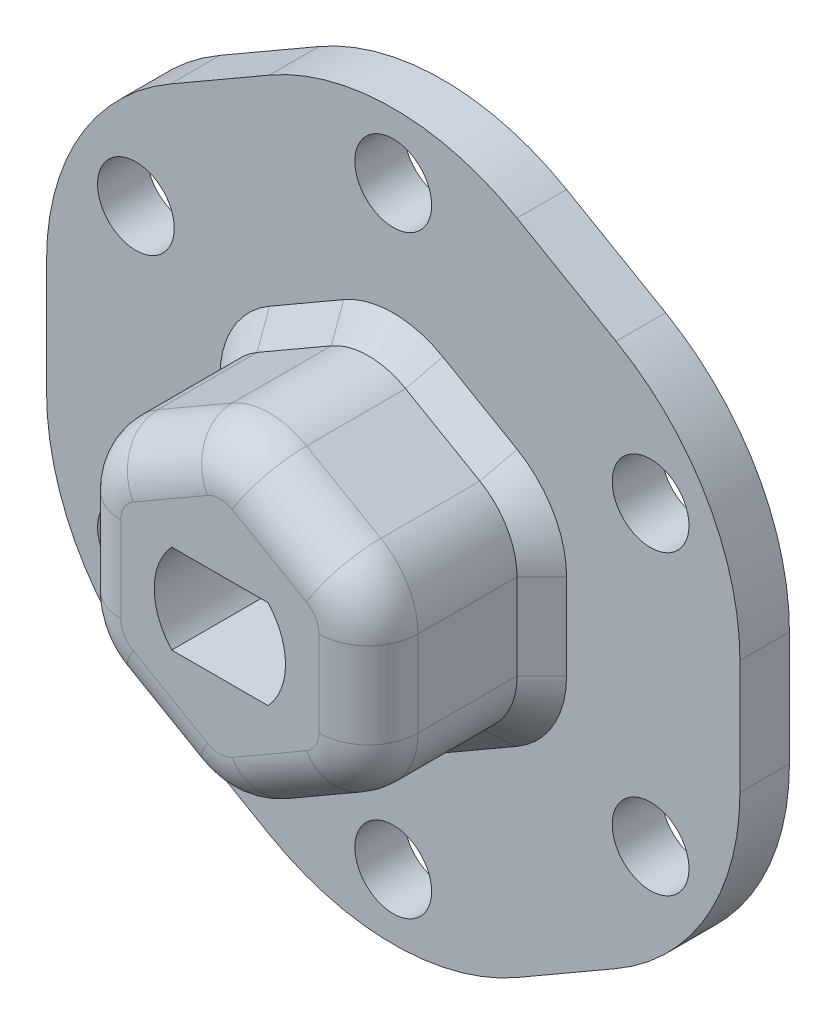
ISO-10303-21;
HEADER;
FILE_DESCRIPTION(('STEP AP214'),'2;1');
FILE_NAME('part.step','',(''),(''),'','','');
FILE_SCHEMA(('AUTOMOTIVE_DESIGN { 1 0 10303 214 1 1 1 1 }'));
ENDSEC;
DATA;
#1=APPLICATION_CONTEXT('core data for automotive mechanical design processes');
#2=APPLICATION_PROTOCOL_DEFINITION('international standard','automotive_design',2000,#1);
#3=PRODUCT_CONTEXT('',#1,'mechanical');
#4=PRODUCT('Part','Part','',(#3));
#5=PRODUCT_RELATED_PRODUCT_CATEGORY('part','',(#4));
#6=PRODUCT_DEFINITION_FORMATION('','',#4);
#7=PRODUCT_DEFINITION_CONTEXT('part definition',#1,'design');
#8=PRODUCT_DEFINITION('design','',#6,#7);
#9=PRODUCT_DEFINITION_SHAPE('','',#8);
#10=(LENGTH_UNIT() NAMED_UNIT(*) SI_UNIT(.MILLI.,.METRE.));
#11=(NAMED_UNIT(*) PLANE_ANGLE_UNIT() SI_UNIT($,.RADIAN.));
#12=(NAMED_UNIT(*) SI_UNIT($,.STERADIAN.) SOLID_ANGLE_UNIT());
#13=UNCERTAINTY_MEASURE_WITH_UNIT(LENGTH_MEASURE(1.E-05),#10,'distance_accuracy_value','');
#14=(GEOMETRIC_REPRESENTATION_CONTEXT(3) GLOBAL_UNCERTAINTY_ASSIGNED_CONTEXT((#13)) GLOBAL_UNIT_ASSIGNED_CONTEXT((#10,
#11,#12)) REPRESENTATION_CONTEXT('',''));
#15=CARTESIAN_POINT('',(0.,0.,0.));
#16=DIRECTION('',(0.,0.,1.));
#17=DIRECTION('',(1.,0.,0.));
#18=AXIS2_PLACEMENT_3D('',#15,#16,#17);
#19=CARTESIAN_POINT('',(4.,2.3094010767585,2.));
#20=DIRECTION('',(0.,0.,1.));
#21=DIRECTION('',(1.,0.,0.));
#22=AXIS2_PLACEMENT_3D('',#19,#20,#21);
#23=PLANE('',#22);
#24=CARTESIAN_POINT('',(3.,-1.73205080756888,2.));
#25=DIRECTION('',(0.,0.,1.));
#26=DIRECTION('',(1.,0.,0.));
#27=AXIS2_PLACEMENT_3D('',#24,#25,#26);
#28=CIRCLE('',#27,3.99999999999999);
#29=CARTESIAN_POINT('',(7.,-1.73205080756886,2.));
#30=VERTEX_POINT('',#29);
#31=CARTESIAN_POINT('',(4.99999999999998,-5.19615242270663,2.));
#32=VERTEX_POINT('',#31);
#33=EDGE_CURVE('E508',#30,#32,#28,.F.);
#34=ORIENTED_EDGE('',*,*,#33,.T.);
#35=DIRECTION('',(-0.866025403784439,-0.5,0.));
#36=VECTOR('',#35,1.);
#37=CARTESIAN_POINT('',(7.49999999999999,-3.75277674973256,2.));
#38=LINE('',#37,#36);
#39=CARTESIAN_POINT('',(2.,-6.92820323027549,2.));
#40=VERTEX_POINT('',#39);
#41=EDGE_CURVE('E510',#32,#40,#38,.T.);
#42=ORIENTED_EDGE('',*,*,#41,.T.);
#43=CARTESIAN_POINT('',(0.,-3.46410161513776,2.));
#44=DIRECTION('',(0.,0.,1.));
#45=DIRECTION('',(1.,0.,0.));
#46=AXIS2_PLACEMENT_3D('',#43,#44,#45);
#47=CIRCLE('',#46,3.99999999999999);
#48=CARTESIAN_POINT('',(-2.00000000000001,-6.9282032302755,2.));
#49=VERTEX_POINT('',#48);
#50=EDGE_CURVE('E506',#40,#49,#47,.F.);
#51=ORIENTED_EDGE('',*,*,#50,.T.);
#52=DIRECTION('',(-0.866025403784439,0.5,0.));
#53=VECTOR('',#52,1.);
#54=CARTESIAN_POINT('',(-1.49999999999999,-7.21687836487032,2.));
#55=LINE('',#54,#53);
#56=CARTESIAN_POINT('',(-4.99999999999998,-5.19615242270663,2.));
#57=VERTEX_POINT('',#56);
#58=EDGE_CURVE('E502',#49,#57,#55,.T.);
#59=ORIENTED_EDGE('',*,*,#58,.T.);
#60=CARTESIAN_POINT('',(-3.,-1.73205080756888,2.));
#61=DIRECTION('',(0.,0.,1.));
#62=DIRECTION('',(1.,0.,0.));
#63=AXIS2_PLACEMENT_3D('',#60,#61,#62);
#64=CIRCLE('',#63,3.99999999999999);
#65=CARTESIAN_POINT('',(-7.,-1.73205080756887,2.));
#66=VERTEX_POINT('',#65);
#67=EDGE_CURVE('E498',#57,#66,#64,.F.);
#68=ORIENTED_EDGE('',*,*,#67,.T.);
#69=DIRECTION('',(0.,1.,0.));
#70=VECTOR('',#69,1.);
#71=CARTESIAN_POINT('',(-7.,2.3094010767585,2.));
#72=LINE('',#71,#70);
#73=CARTESIAN_POINT('',(-6.99999999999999,1.73205080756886,2.));
#74=VERTEX_POINT('',#73);
#75=EDGE_CURVE('E493',#66,#74,#72,.T.);
#76=ORIENTED_EDGE('',*,*,#75,.T.);
#77=CARTESIAN_POINT('',(-3.,1.73205080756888,2.));
#78=DIRECTION('',(0.,0.,1.));
#79=DIRECTION('',(1.,0.,0.));
#80=AXIS2_PLACEMENT_3D('',#77,#78,#79);
#81=CIRCLE('',#80,3.99999999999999);
#82=CARTESIAN_POINT('',(-4.99999999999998,5.19615242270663,2.));
#83=VERTEX_POINT('',#82);
#84=EDGE_CURVE('E489',#74,#83,#81,.F.);
#85=ORIENTED_EDGE('',*,*,#84,.T.);
#86=DIRECTION('',(0.866025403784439,0.5,0.));
#87=VECTOR('',#86,1.);
#88=CARTESIAN_POINT('',(0.500000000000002,8.37157890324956,2.));
#89=LINE('',#88,#87);
#90=CARTESIAN_POINT('',(-2.00000000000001,6.92820323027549,2.));
#91=VERTEX_POINT('',#90);
#92=EDGE_CURVE('E487',#83,#91,#89,.T.);
#93=ORIENTED_EDGE('',*,*,#92,.T.);
#94=CARTESIAN_POINT('',(0.,3.46410161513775,2.));
#95=DIRECTION('',(0.,0.,1.));
#96=DIRECTION('',(1.,0.,0.));
#97=AXIS2_PLACEMENT_3D('',#94,#95,#96);
#98=CIRCLE('',#97,3.99999999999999);
#99=CARTESIAN_POINT('',(2.00000000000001,6.92820323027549,2.));
#100=VERTEX_POINT('',#99);
#101=EDGE_CURVE('E491',#91,#100,#98,.F.);
#102=ORIENTED_EDGE('',*,*,#101,.T.);
#103=DIRECTION('',(0.866025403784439,-0.5,0.));
#104=VECTOR('',#103,1.);
#105=CARTESIAN_POINT('',(5.49999999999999,4.90747728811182,2.));
#106=LINE('',#105,#104);
#107=CARTESIAN_POINT('',(4.99999999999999,5.19615242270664,2.));
#108=VERTEX_POINT('',#107);
#109=EDGE_CURVE('E495',#100,#108,#106,.T.);
#110=ORIENTED_EDGE('',*,*,#109,.T.);
#111=CARTESIAN_POINT('',(3.,1.73205080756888,2.));
#112=DIRECTION('',(0.,0.,1.));
#113=DIRECTION('',(1.,0.,0.));
#114=AXIS2_PLACEMENT_3D('',#111,#112,#113);
#115=CIRCLE('',#114,3.99999999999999);
#116=CARTESIAN_POINT('',(6.99999999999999,1.73205080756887,2.));
#117=VERTEX_POINT('',#116);
#118=EDGE_CURVE('E500',#108,#117,#115,.F.);
#119=ORIENTED_EDGE('',*,*,#118,.T.);
#120=DIRECTION('',(0.,-1.,0.));
#121=VECTOR('',#120,1.);
#122=CARTESIAN_POINT('',(7.,2.30940107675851,2.));
#123=LINE('',#122,#121);
#124=EDGE_CURVE('E504',#117,#30,#123,.T.);
#125=ORIENTED_EDGE('',*,*,#124,.T.);
#126=EDGE_LOOP('',(#34,#42,#51,#59,#68,#76,#85,#93,#102,#110,#119,#125));
#127=FACE_BOUND('',#126,.T.);
#128=CARTESIAN_POINT('',(-10.3923048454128,5.99999999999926,2.));
#129=DIRECTION('',(0.,0.,1.));
#130=DIRECTION('',(1.,0.,0.));
#131=AXIS2_PLACEMENT_3D('',#128,#129,#130);
#132=CIRCLE('',#131,1.55000000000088);
#133=CARTESIAN_POINT('',(-8.84230484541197,5.99999999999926,2.));
#134=VERTEX_POINT('',#133);
#135=EDGE_CURVE('E363',#134,#134,#132,.T.);
#136=ORIENTED_EDGE('',*,*,#135,.F.);
#137=EDGE_LOOP('',(#136));
#138=FACE_BOUND('',#137,.T.);
#139=CARTESIAN_POINT('',(1.70236341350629E-12,-12.,2.));
#140=DIRECTION('',(0.,0.,1.));
#141=DIRECTION('',(1.,0.,0.));
#142=AXIS2_PLACEMENT_3D('',#139,#140,#141);
#143=CIRCLE('',#142,1.55000000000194);
#144=CARTESIAN_POINT('',(1.55000000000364,-12.,2.));
#145=VERTEX_POINT('',#144);
#146=EDGE_CURVE('E375',#145,#145,#143,.T.);
#147=ORIENTED_EDGE('',*,*,#146,.F.);
#148=EDGE_LOOP('',(#147));
#149=FACE_BOUND('',#148,.T.);
#150=CARTESIAN_POINT('',(10.3923048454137,6.00000000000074,2.));
#151=DIRECTION('',(0.,0.,1.));
#152=DIRECTION('',(1.,0.,0.));
#153=AXIS2_PLACEMENT_3D('',#150,#151,#152);
#154=CIRCLE('',#153,1.55000000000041);
#155=CARTESIAN_POINT('',(11.9423048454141,6.00000000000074,2.));
#156=VERTEX_POINT('',#155);
#157=EDGE_CURVE('E387',#156,#156,#154,.T.);
#158=ORIENTED_EDGE('',*,*,#157,.F.);
#159=EDGE_LOOP('',(#158));
#160=FACE_BOUND('',#159,.T.);
#161=CARTESIAN_POINT('',(4.,2.3094010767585,2.));
#162=DIRECTION('',(0.,0.,1.));
#163=DIRECTION('',(1.,0.,0.));
#164=AXIS2_PLACEMENT_3D('',#161,#162,#163);
#165=CIRCLE('',#164,10.);
#166=CARTESIAN_POINT('',(14.,2.30940107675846,2.));
#167=VERTEX_POINT('',#166);
#168=CARTESIAN_POINT('',(8.99999999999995,10.9696551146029,2.));
#169=VERTEX_POINT('',#168);
#170=EDGE_CURVE('E399',#167,#169,#165,.T.);
#171=ORIENTED_EDGE('',*,*,#170,.T.);
#172=DIRECTION('',(-0.866025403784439,0.5,0.));
#173=VECTOR('',#172,1.);
#174=CARTESIAN_POINT('',(8.99999999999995,10.9696551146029,2.));
#175=LINE('',#174,#173);
#176=CARTESIAN_POINT('',(5.00000000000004,13.2790561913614,2.));
#177=VERTEX_POINT('',#176);
#178=EDGE_CURVE('E402',#169,#177,#175,.T.);
#179=ORIENTED_EDGE('',*,*,#178,.T.);
#180=CARTESIAN_POINT('',(0.,4.61880215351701,2.));
#181=DIRECTION('',(0.,0.,1.));
#182=DIRECTION('',(-1.,0.,0.));
#183=AXIS2_PLACEMENT_3D('',#180,#181,#182);
#184=CIRCLE('',#183,10.);
#185=CARTESIAN_POINT('',(-5.00000000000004,13.2790561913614,2.));
#186=VERTEX_POINT('',#185);
#187=EDGE_CURVE('E405',#177,#186,#184,.T.);
#188=ORIENTED_EDGE('',*,*,#187,.T.);
#189=DIRECTION('',(-0.866025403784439,-0.5,0.));
#190=VECTOR('',#189,1.);
#191=CARTESIAN_POINT('',(-5.00000000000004,13.2790561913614,2.));
#192=LINE('',#191,#190);
#193=CARTESIAN_POINT('',(-8.99999999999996,10.9696551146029,2.));
#194=VERTEX_POINT('',#193);
#195=EDGE_CURVE('E407',#186,#194,#192,.T.);
#196=ORIENTED_EDGE('',*,*,#195,.T.);
#197=CARTESIAN_POINT('',(-4.,2.3094010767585,2.));
#198=DIRECTION('',(0.,0.,1.));
#199=DIRECTION('',(1.,0.,0.));
#200=AXIS2_PLACEMENT_3D('',#197,#198,#199);
#201=CIRCLE('',#200,10.);
#202=CARTESIAN_POINT('',(-14.,2.30940107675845,2.));
#203=VERTEX_POINT('',#202);
#204=EDGE_CURVE('E409',#194,#203,#201,.T.);
#205=ORIENTED_EDGE('',*,*,#204,.T.);
#206=DIRECTION('',(0.,-1.,0.));
#207=VECTOR('',#206,1.);
#208=CARTESIAN_POINT('',(-14.,2.30940107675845,2.));
#209=LINE('',#208,#207);
#210=CARTESIAN_POINT('',(-14.,-2.30940107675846,2.));
#211=VERTEX_POINT('',#210);
#212=EDGE_CURVE('E411',#203,#211,#209,.T.);
#213=ORIENTED_EDGE('',*,*,#212,.T.);
#214=CARTESIAN_POINT('',(-4.,-2.30940107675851,2.));
#215=DIRECTION('',(0.,0.,1.));
#216=DIRECTION('',(1.,0.,0.));
#217=AXIS2_PLACEMENT_3D('',#214,#215,#216);
#218=CIRCLE('',#217,10.);
#219=CARTESIAN_POINT('',(-8.99999999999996,-10.9696551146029,2.));
#220=VERTEX_POINT('',#219);
#221=EDGE_CURVE('E413',#211,#220,#218,.T.);
#222=ORIENTED_EDGE('',*,*,#221,.T.);
#223=DIRECTION('',(0.866025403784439,-0.5,0.));
#224=VECTOR('',#223,1.);
#225=CARTESIAN_POINT('',(-8.99999999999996,-10.9696551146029,2.));
#226=LINE('',#225,#224);
#227=CARTESIAN_POINT('',(-5.00000000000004,-13.2790561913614,2.));
#228=VERTEX_POINT('',#227);
#229=EDGE_CURVE('E415',#220,#228,#226,.T.);
#230=ORIENTED_EDGE('',*,*,#229,.T.);
#231=CARTESIAN_POINT('',(0.,-4.61880215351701,2.));
#232=DIRECTION('',(0.,0.,1.));
#233=DIRECTION('',(1.,0.,0.));
#234=AXIS2_PLACEMENT_3D('',#231,#232,#233);
#235=CIRCLE('',#234,10.);
#236=CARTESIAN_POINT('',(5.00000000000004,-13.2790561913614,2.));
#237=VERTEX_POINT('',#236);
#238=EDGE_CURVE('E417',#228,#237,#235,.T.);
#239=ORIENTED_EDGE('',*,*,#238,.T.);
#240=DIRECTION('',(0.866025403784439,0.5,0.));
#241=VECTOR('',#240,1.);
#242=CARTESIAN_POINT('',(5.00000000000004,-13.2790561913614,2.));
#243=LINE('',#242,#241);
#244=CARTESIAN_POINT('',(8.99999999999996,-10.9696551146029,2.));
#245=VERTEX_POINT('',#244);
#246=EDGE_CURVE('E419',#237,#245,#243,.T.);
#247=ORIENTED_EDGE('',*,*,#246,.T.);
#248=CARTESIAN_POINT('',(4.,-2.30940107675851,2.));
#249=DIRECTION('',(0.,0.,1.));
#250=DIRECTION('',(1.,0.,0.));
#251=AXIS2_PLACEMENT_3D('',#248,#249,#250);
#252=CIRCLE('',#251,10.);
#253=CARTESIAN_POINT('',(14.,-2.30940107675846,2.));
#254=VERTEX_POINT('',#253);
#255=EDGE_CURVE('E421',#245,#254,#252,.T.);
#256=ORIENTED_EDGE('',*,*,#255,.T.);
#257=DIRECTION('',(0.,1.,0.));
#258=VECTOR('',#257,1.);
#259=CARTESIAN_POINT('',(14.,-2.30940107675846,2.));
#260=LINE('',#259,#258);
#261=EDGE_CURVE('E423',#254,#167,#260,.T.);
#262=ORIENTED_EDGE('',*,*,#261,.T.);
#263=EDGE_LOOP('',(#171,#179,#188,#196,#205,#213,#222,#230,#239,#247,#256,#262));
#264=FACE_BOUND('',#263,.T.);
#265=CARTESIAN_POINT('',(0.,12.,2.));
#266=DIRECTION('',(0.,0.,1.));
#267=DIRECTION('',(1.,0.,0.));
#268=AXIS2_PLACEMENT_3D('',#265,#266,#267);
#269=CIRCLE('',#268,1.55);
#270=CARTESIAN_POINT('',(1.55,12.,2.));
#271=VERTEX_POINT('',#270);
#272=EDGE_CURVE('E393',#271,#271,#269,.T.);
#273=ORIENTED_EDGE('',*,*,#272,.F.);
#274=EDGE_LOOP('',(#273));
#275=FACE_BOUND('',#274,.T.);
#276=CARTESIAN_POINT('',(10.3923048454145,-5.99999999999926,2.));
#277=DIRECTION('',(0.,0.,1.));
#278=DIRECTION('',(1.,0.,0.));
#279=AXIS2_PLACEMENT_3D('',#276,#277,#278);
#280=CIRCLE('',#279,1.55000000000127);
#281=CARTESIAN_POINT('',(11.9423048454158,-5.99999999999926,2.));
#282=VERTEX_POINT('',#281);
#283=EDGE_CURVE('E381',#282,#282,#280,.T.);
#284=ORIENTED_EDGE('',*,*,#283,.F.);
#285=EDGE_LOOP('',(#284));
#286=FACE_BOUND('',#285,.T.);
#287=CARTESIAN_POINT('',(-10.392304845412,-6.00000000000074,2.));
#288=DIRECTION('',(0.,0.,1.));
#289=DIRECTION('',(1.,0.,0.));
#290=AXIS2_PLACEMENT_3D('',#287,#288,#289);
#291=CIRCLE('',#290,1.55000000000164);
#292=CARTESIAN_POINT('',(-8.84230484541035,-6.00000000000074,2.));
#293=VERTEX_POINT('',#292);
#294=EDGE_CURVE('E369',#293,#293,#291,.T.);
#295=ORIENTED_EDGE('',*,*,#294,.F.);
#296=EDGE_LOOP('',(#295));
#297=FACE_BOUND('',#296,.T.);
#298=ADVANCED_FACE('F37',(#127,#138,#149,#160,#264,#275,#286,#297),#23,.T.);
#299=CARTESIAN_POINT('',(4.,2.3094010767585,0.));
#300=DIRECTION('',(0.,0.,1.));
#301=DIRECTION('',(1.,0.,0.));
#302=AXIS2_PLACEMENT_3D('',#299,#300,#301);
#303=PLANE('',#302);
#304=CARTESIAN_POINT('',(4.,2.3094010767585,0.));
#305=DIRECTION('',(0.,0.,1.));
#306=DIRECTION('',(1.,0.,0.));
#307=AXIS2_PLACEMENT_3D('',#304,#305,#306);
#308=CIRCLE('',#307,10.);
#309=CARTESIAN_POINT('',(14.,2.30940107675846,0.));
#310=VERTEX_POINT('',#309);
#311=CARTESIAN_POINT('',(8.99999999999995,10.9696551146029,0.));
#312=VERTEX_POINT('',#311);
#313=EDGE_CURVE('E396',#310,#312,#308,.T.);
#314=ORIENTED_EDGE('',*,*,#313,.F.);
#315=DIRECTION('',(0.,1.,0.));
#316=VECTOR('',#315,1.);
#317=CARTESIAN_POINT('',(14.,-2.30940107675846,0.));
#318=LINE('',#317,#316);
#319=CARTESIAN_POINT('',(14.,-2.30940107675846,0.));
#320=VERTEX_POINT('',#319);
#321=EDGE_CURVE('E403',#320,#310,#318,.T.);
#322=ORIENTED_EDGE('',*,*,#321,.F.);
#323=CARTESIAN_POINT('',(4.,-2.30940107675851,0.));
#324=DIRECTION('',(0.,0.,1.));
#325=DIRECTION('',(1.,0.,0.));
#326=AXIS2_PLACEMENT_3D('',#323,#324,#325);
#327=CIRCLE('',#326,10.);
#328=CARTESIAN_POINT('',(8.99999999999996,-10.9696551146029,0.));
#329=VERTEX_POINT('',#328);
#330=EDGE_CURVE('E446',#329,#320,#327,.T.);
#331=ORIENTED_EDGE('',*,*,#330,.F.);
#332=DIRECTION('',(0.866025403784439,0.5,0.));
#333=VECTOR('',#332,1.);
#334=CARTESIAN_POINT('',(5.00000000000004,-13.2790561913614,0.));
#335=LINE('',#334,#333);
#336=CARTESIAN_POINT('',(5.00000000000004,-13.2790561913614,0.));
#337=VERTEX_POINT('',#336);
#338=EDGE_CURVE('E444',#337,#329,#335,.T.);
#339=ORIENTED_EDGE('',*,*,#338,.F.);
#340=CARTESIAN_POINT('',(0.,-4.61880215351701,0.));
#341=DIRECTION('',(0.,0.,1.));
#342=DIRECTION('',(1.,0.,0.));
#343=AXIS2_PLACEMENT_3D('',#340,#341,#342);
#344=CIRCLE('',#343,10.);
#345=CARTESIAN_POINT('',(-5.00000000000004,-13.2790561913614,0.));
#346=VERTEX_POINT('',#345);
#347=EDGE_CURVE('E442',#346,#337,#344,.T.);
#348=ORIENTED_EDGE('',*,*,#347,.F.);
#349=DIRECTION('',(0.866025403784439,-0.5,0.));
#350=VECTOR('',#349,1.);
#351=CARTESIAN_POINT('',(-8.99999999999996,-10.9696551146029,0.));
#352=LINE('',#351,#350);
#353=CARTESIAN_POINT('',(-8.99999999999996,-10.9696551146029,0.));
#354=VERTEX_POINT('',#353);
#355=EDGE_CURVE('E440',#354,#346,#352,.T.);
#356=ORIENTED_EDGE('',*,*,#355,.F.);
#357=CARTESIAN_POINT('',(-4.,-2.30940107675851,0.));
#358=DIRECTION('',(0.,0.,1.));
#359=DIRECTION('',(1.,0.,0.));
#360=AXIS2_PLACEMENT_3D('',#357,#358,#359);
#361=CIRCLE('',#360,10.);
#362=CARTESIAN_POINT('',(-14.,-2.30940107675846,0.));
#363=VERTEX_POINT('',#362);
#364=EDGE_CURVE('E438',#363,#354,#361,.T.);
#365=ORIENTED_EDGE('',*,*,#364,.F.);
#366=DIRECTION('',(0.,-1.,0.));
#367=VECTOR('',#366,1.);
#368=CARTESIAN_POINT('',(-14.,2.30940107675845,0.));
#369=LINE('',#368,#367);
#370=CARTESIAN_POINT('',(-14.,2.30940107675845,0.));
#371=VERTEX_POINT('',#370);
#372=EDGE_CURVE('E436',#371,#363,#369,.T.);
#373=ORIENTED_EDGE('',*,*,#372,.F.);
#374=CARTESIAN_POINT('',(-4.,2.3094010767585,0.));
#375=DIRECTION('',(0.,0.,1.));
#376=DIRECTION('',(1.,0.,0.));
#377=AXIS2_PLACEMENT_3D('',#374,#375,#376);
#378=CIRCLE('',#377,10.);
#379=CARTESIAN_POINT('',(-8.99999999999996,10.9696551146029,0.));
#380=VERTEX_POINT('',#379);
#381=EDGE_CURVE('E434',#380,#371,#378,.T.);
#382=ORIENTED_EDGE('',*,*,#381,.F.);
#383=DIRECTION('',(-0.866025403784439,-0.5,0.));
#384=VECTOR('',#383,1.);
#385=CARTESIAN_POINT('',(-5.00000000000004,13.2790561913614,0.));
#386=LINE('',#385,#384);
#387=CARTESIAN_POINT('',(-5.00000000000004,13.2790561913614,0.));
#388=VERTEX_POINT('',#387);
#389=EDGE_CURVE('E432',#388,#380,#386,.T.);
#390=ORIENTED_EDGE('',*,*,#389,.F.);
#391=CARTESIAN_POINT('',(0.,4.61880215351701,0.));
#392=DIRECTION('',(0.,0.,1.));
#393=DIRECTION('',(-1.,0.,0.));
#394=AXIS2_PLACEMENT_3D('',#391,#392,#393);
#395=CIRCLE('',#394,10.);
#396=CARTESIAN_POINT('',(5.00000000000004,13.2790561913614,0.));
#397=VERTEX_POINT('',#396);
#398=EDGE_CURVE('E430',#397,#388,#395,.T.);
#399=ORIENTED_EDGE('',*,*,#398,.F.);
#400=DIRECTION('',(-0.866025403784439,0.5,0.));
#401=VECTOR('',#400,1.);
#402=CARTESIAN_POINT('',(8.99999999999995,10.9696551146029,0.));
#403=LINE('',#402,#401);
#404=EDGE_CURVE('E428',#312,#397,#403,.T.);
#405=ORIENTED_EDGE('',*,*,#404,.F.);
#406=EDGE_LOOP('',(#314,#322,#331,#339,#348,#356,#365,#373,#382,#390,#399,#405));
#407=FACE_BOUND('',#406,.T.);
#408=CARTESIAN_POINT('',(0.,12.,0.));
#409=DIRECTION('',(0.,0.,1.));
#410=DIRECTION('',(1.,0.,0.));
#411=AXIS2_PLACEMENT_3D('',#408,#409,#410);
#412=CIRCLE('',#411,1.55);
#413=CARTESIAN_POINT('',(1.55,12.,0.));
#414=VERTEX_POINT('',#413);
#415=EDGE_CURVE('E390',#414,#414,#412,.T.);
#416=ORIENTED_EDGE('',*,*,#415,.T.);
#417=EDGE_LOOP('',(#416));
#418=FACE_BOUND('',#417,.T.);
#419=CARTESIAN_POINT('',(10.3923048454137,6.00000000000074,0.));
#420=DIRECTION('',(0.,0.,1.));
#421=DIRECTION('',(1.,0.,0.));
#422=AXIS2_PLACEMENT_3D('',#419,#420,#421);
#423=CIRCLE('',#422,1.55000000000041);
#424=CARTESIAN_POINT('',(11.9423048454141,6.00000000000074,0.));
#425=VERTEX_POINT('',#424);
#426=EDGE_CURVE('E384',#425,#425,#423,.T.);
#427=ORIENTED_EDGE('',*,*,#426,.T.);
#428=EDGE_LOOP('',(#427));
#429=FACE_BOUND('',#428,.T.);
#430=CARTESIAN_POINT('',(10.3923048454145,-5.99999999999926,0.));
#431=DIRECTION('',(0.,0.,1.));
#432=DIRECTION('',(1.,0.,0.));
#433=AXIS2_PLACEMENT_3D('',#430,#431,#432);
#434=CIRCLE('',#433,1.55000000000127);
#435=CARTESIAN_POINT('',(11.9423048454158,-5.99999999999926,0.));
#436=VERTEX_POINT('',#435);
#437=EDGE_CURVE('E378',#436,#436,#434,.T.);
#438=ORIENTED_EDGE('',*,*,#437,.T.);
#439=EDGE_LOOP('',(#438));
#440=FACE_BOUND('',#439,.T.);
#441=CARTESIAN_POINT('',(1.70236341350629E-12,-12.,0.));
#442=DIRECTION('',(0.,0.,1.));
#443=DIRECTION('',(1.,0.,0.));
#444=AXIS2_PLACEMENT_3D('',#441,#442,#443);
#445=CIRCLE('',#444,1.55000000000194);
#446=CARTESIAN_POINT('',(1.55000000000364,-12.,0.));
#447=VERTEX_POINT('',#446);
#448=EDGE_CURVE('E372',#447,#447,#445,.T.);
#449=ORIENTED_EDGE('',*,*,#448,.T.);
#450=EDGE_LOOP('',(#449));
#451=FACE_BOUND('',#450,.T.);
#452=CARTESIAN_POINT('',(-10.392304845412,-6.00000000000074,0.));
#453=DIRECTION('',(0.,0.,1.));
#454=DIRECTION('',(1.,0.,0.));
#455=AXIS2_PLACEMENT_3D('',#452,#453,#454);
#456=CIRCLE('',#455,1.55000000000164);
#457=CARTESIAN_POINT('',(-8.84230484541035,-6.00000000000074,0.));
#458=VERTEX_POINT('',#457);
#459=EDGE_CURVE('E366',#458,#458,#456,.T.);
#460=ORIENTED_EDGE('',*,*,#459,.T.);
#461=EDGE_LOOP('',(#460));
#462=FACE_BOUND('',#461,.T.);
#463=CARTESIAN_POINT('',(-10.3923048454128,5.99999999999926,0.));
#464=DIRECTION('',(0.,0.,1.));
#465=DIRECTION('',(1.,0.,0.));
#466=AXIS2_PLACEMENT_3D('',#463,#464,#465);
#467=CIRCLE('',#466,1.55000000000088);
#468=CARTESIAN_POINT('',(-8.84230484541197,5.99999999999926,0.));
#469=VERTEX_POINT('',#468);
#470=EDGE_CURVE('E362',#469,#469,#467,.T.);
#471=ORIENTED_EDGE('',*,*,#470,.T.);
#472=EDGE_LOOP('',(#471));
#473=FACE_BOUND('',#472,.T.);
#474=ADVANCED_FACE('F745',(#407,#418,#429,#440,#451,#462,#473),#303,.F.);
#475=CARTESIAN_POINT('',(4.,2.3094010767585,2.));
#476=DIRECTION('',(0.,0.,-1.));
#477=DIRECTION('',(-1.,0.,0.));
#478=AXIS2_PLACEMENT_3D('',#475,#476,#477);
#479=CYLINDRICAL_SURFACE('',#478,10.);
#480=ORIENTED_EDGE('',*,*,#313,.T.);
#481=DIRECTION('',(0.,0.,-1.));
#482=VECTOR('',#481,1.);
#483=CARTESIAN_POINT('',(8.99999999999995,10.9696551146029,2.));
#484=LINE('',#483,#482);
#485=EDGE_CURVE('E481',#169,#312,#484,.T.);
#486=ORIENTED_EDGE('',*,*,#485,.F.);
#487=ORIENTED_EDGE('',*,*,#170,.F.);
#488=DIRECTION('',(0.,0.,-1.));
#489=VECTOR('',#488,1.);
#490=CARTESIAN_POINT('',(14.,2.30940107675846,2.));
#491=LINE('',#490,#489);
#492=EDGE_CURVE('E425',#167,#310,#491,.T.);
#493=ORIENTED_EDGE('',*,*,#492,.T.);
#494=EDGE_LOOP('',(#480,#486,#487,#493));
#495=FACE_BOUND('',#494,.T.);
#496=ADVANCED_FACE('F751',(#495),#479,.T.);
#497=CARTESIAN_POINT('',(8.99999999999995,10.9696551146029,2.));
#498=DIRECTION('',(-0.5,-0.866025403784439,0.));
#499=DIRECTION('',(0.866025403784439,-0.5,0.));
#500=AXIS2_PLACEMENT_3D('',#497,#498,#499);
#501=PLANE('',#500);
#502=ORIENTED_EDGE('',*,*,#404,.T.);
#503=DIRECTION('',(0.,0.,-1.));
#504=VECTOR('',#503,1.);
#505=CARTESIAN_POINT('',(5.00000000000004,13.2790561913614,2.));
#506=LINE('',#505,#504);
#507=EDGE_CURVE('E478',#177,#397,#506,.T.);
#508=ORIENTED_EDGE('',*,*,#507,.F.);
#509=ORIENTED_EDGE('',*,*,#178,.F.);
#510=ORIENTED_EDGE('',*,*,#485,.T.);
#511=EDGE_LOOP('',(#502,#508,#509,#510));
#512=FACE_BOUND('',#511,.T.);
#513=ADVANCED_FACE('F907',(#512),#501,.F.);
#514=CARTESIAN_POINT('',(0.,4.61880215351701,2.));
#515=DIRECTION('',(0.,0.,-1.));
#516=DIRECTION('',(-1.,0.,0.));
#517=AXIS2_PLACEMENT_3D('',#514,#515,#516);
#518=CYLINDRICAL_SURFACE('',#517,10.);
#519=ORIENTED_EDGE('',*,*,#398,.T.);
#520=DIRECTION('',(0.,0.,-1.));
#521=VECTOR('',#520,1.);
#522=CARTESIAN_POINT('',(-5.00000000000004,13.2790561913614,2.));
#523=LINE('',#522,#521);
#524=EDGE_CURVE('E475',#186,#388,#523,.T.);
#525=ORIENTED_EDGE('',*,*,#524,.F.);
#526=ORIENTED_EDGE('',*,*,#187,.F.);
#527=ORIENTED_EDGE('',*,*,#507,.T.);
#528=EDGE_LOOP('',(#519,#525,#526,#527));
#529=FACE_BOUND('',#528,.T.);
#530=ADVANCED_FACE('F903',(#529),#518,.T.);
#531=CARTESIAN_POINT('',(-5.00000000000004,13.2790561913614,2.));
#532=DIRECTION('',(0.5,-0.866025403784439,0.));
#533=DIRECTION('',(0.866025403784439,0.5,0.));
#534=AXIS2_PLACEMENT_3D('',#531,#532,#533);
#535=PLANE('',#534);
#536=ORIENTED_EDGE('',*,*,#389,.T.);
#537=DIRECTION('',(0.,0.,-1.));
#538=VECTOR('',#537,1.);
#539=CARTESIAN_POINT('',(-8.99999999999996,10.9696551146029,2.));
#540=LINE('',#539,#538);
#541=EDGE_CURVE('E472',#194,#380,#540,.T.);
#542=ORIENTED_EDGE('',*,*,#541,.F.);
#543=ORIENTED_EDGE('',*,*,#195,.F.);
#544=ORIENTED_EDGE('',*,*,#524,.T.);
#545=EDGE_LOOP('',(#536,#542,#543,#544));
#546=FACE_BOUND('',#545,.T.);
#547=ADVANCED_FACE('F899',(#546),#535,.F.);
#548=CARTESIAN_POINT('',(-4.,2.3094010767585,2.));
#549=DIRECTION('',(0.,0.,-1.));
#550=DIRECTION('',(-1.,0.,0.));
#551=AXIS2_PLACEMENT_3D('',#548,#549,#550);
#552=CYLINDRICAL_SURFACE('',#551,10.);
#553=ORIENTED_EDGE('',*,*,#381,.T.);
#554=DIRECTION('',(0.,0.,-1.));
#555=VECTOR('',#554,1.);
#556=CARTESIAN_POINT('',(-14.,2.30940107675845,2.));
#557=LINE('',#556,#555);
#558=EDGE_CURVE('E469',#203,#371,#557,.T.);
#559=ORIENTED_EDGE('',*,*,#558,.F.);
#560=ORIENTED_EDGE('',*,*,#204,.F.);
#561=ORIENTED_EDGE('',*,*,#541,.T.);
#562=EDGE_LOOP('',(#553,#559,#560,#561));
#563=FACE_BOUND('',#562,.T.);
#564=ADVANCED_FACE('F895',(#563),#552,.T.);
#565=CARTESIAN_POINT('',(-14.,2.30940107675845,2.));
#566=DIRECTION('',(1.,0.,0.));
#567=DIRECTION('',(0.,1.,0.));
#568=AXIS2_PLACEMENT_3D('',#565,#566,#567);
#569=PLANE('',#568);
#570=ORIENTED_EDGE('',*,*,#372,.T.);
#571=DIRECTION('',(0.,0.,-1.));
#572=VECTOR('',#571,1.);
#573=CARTESIAN_POINT('',(-14.,-2.30940107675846,2.));
#574=LINE('',#573,#572);
#575=EDGE_CURVE('E466',#211,#363,#574,.T.);
#576=ORIENTED_EDGE('',*,*,#575,.F.);
#577=ORIENTED_EDGE('',*,*,#212,.F.);
#578=ORIENTED_EDGE('',*,*,#558,.T.);
#579=EDGE_LOOP('',(#570,#576,#577,#578));
#580=FACE_BOUND('',#579,.T.);
#581=ADVANCED_FACE('F891',(#580),#569,.F.);
#582=CARTESIAN_POINT('',(-4.,-2.30940107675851,2.));
#583=DIRECTION('',(0.,0.,-1.));
#584=DIRECTION('',(-1.,0.,0.));
#585=AXIS2_PLACEMENT_3D('',#582,#583,#584);
#586=CYLINDRICAL_SURFACE('',#585,10.);
#587=ORIENTED_EDGE('',*,*,#364,.T.);
#588=DIRECTION('',(0.,0.,-1.));
#589=VECTOR('',#588,1.);
#590=CARTESIAN_POINT('',(-8.99999999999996,-10.9696551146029,2.));
#591=LINE('',#590,#589);
#592=EDGE_CURVE('E463',#220,#354,#591,.T.);
#593=ORIENTED_EDGE('',*,*,#592,.F.);
#594=ORIENTED_EDGE('',*,*,#221,.F.);
#595=ORIENTED_EDGE('',*,*,#575,.T.);
#596=EDGE_LOOP('',(#587,#593,#594,#595));
#597=FACE_BOUND('',#596,.T.);
#598=ADVANCED_FACE('F887',(#597),#586,.T.);
#599=CARTESIAN_POINT('',(-8.99999999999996,-10.9696551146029,2.));
#600=DIRECTION('',(0.5,0.866025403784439,0.));
#601=DIRECTION('',(-0.866025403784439,0.5,0.));
#602=AXIS2_PLACEMENT_3D('',#599,#600,#601);
#603=PLANE('',#602);
#604=ORIENTED_EDGE('',*,*,#355,.T.);
#605=DIRECTION('',(0.,0.,-1.));
#606=VECTOR('',#605,1.);
#607=CARTESIAN_POINT('',(-5.00000000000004,-13.2790561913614,2.));
#608=LINE('',#607,#606);
#609=EDGE_CURVE('E460',#228,#346,#608,.T.);
#610=ORIENTED_EDGE('',*,*,#609,.F.);
#611=ORIENTED_EDGE('',*,*,#229,.F.);
#612=ORIENTED_EDGE('',*,*,#592,.T.);
#613=EDGE_LOOP('',(#604,#610,#611,#612));
#614=FACE_BOUND('',#613,.T.);
#615=ADVANCED_FACE('F883',(#614),#603,.F.);
#616=CARTESIAN_POINT('',(0.,-4.61880215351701,2.));
#617=DIRECTION('',(0.,0.,-1.));
#618=DIRECTION('',(-1.,0.,0.));
#619=AXIS2_PLACEMENT_3D('',#616,#617,#618);
#620=CYLINDRICAL_SURFACE('',#619,10.);
#621=ORIENTED_EDGE('',*,*,#347,.T.);
#622=DIRECTION('',(0.,0.,-1.));
#623=VECTOR('',#622,1.);
#624=CARTESIAN_POINT('',(5.00000000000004,-13.2790561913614,2.));
#625=LINE('',#624,#623);
#626=EDGE_CURVE('E457',#237,#337,#625,.T.);
#627=ORIENTED_EDGE('',*,*,#626,.F.);
#628=ORIENTED_EDGE('',*,*,#238,.F.);
#629=ORIENTED_EDGE('',*,*,#609,.T.);
#630=EDGE_LOOP('',(#621,#627,#628,#629));
#631=FACE_BOUND('',#630,.T.);
#632=ADVANCED_FACE('F879',(#631),#620,.T.);
#633=CARTESIAN_POINT('',(5.00000000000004,-13.2790561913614,2.));
#634=DIRECTION('',(-0.5,0.866025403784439,0.));
#635=DIRECTION('',(-0.866025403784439,-0.5,0.));
#636=AXIS2_PLACEMENT_3D('',#633,#634,#635);
#637=PLANE('',#636);
#638=ORIENTED_EDGE('',*,*,#338,.T.);
#639=DIRECTION('',(0.,0.,-1.));
#640=VECTOR('',#639,1.);
#641=CARTESIAN_POINT('',(8.99999999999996,-10.9696551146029,2.));
#642=LINE('',#641,#640);
#643=EDGE_CURVE('E454',#245,#329,#642,.T.);
#644=ORIENTED_EDGE('',*,*,#643,.F.);
#645=ORIENTED_EDGE('',*,*,#246,.F.);
#646=ORIENTED_EDGE('',*,*,#626,.T.);
#647=EDGE_LOOP('',(#638,#644,#645,#646));
#648=FACE_BOUND('',#647,.T.);
#649=ADVANCED_FACE('F873',(#648),#637,.F.);
#650=CARTESIAN_POINT('',(4.,-2.30940107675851,2.));
#651=DIRECTION('',(0.,0.,-1.));
#652=DIRECTION('',(-1.,0.,0.));
#653=AXIS2_PLACEMENT_3D('',#650,#651,#652);
#654=CYLINDRICAL_SURFACE('',#653,10.);
#655=ORIENTED_EDGE('',*,*,#330,.T.);
#656=DIRECTION('',(0.,0.,-1.));
#657=VECTOR('',#656,1.);
#658=CARTESIAN_POINT('',(14.,-2.30940107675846,2.));
#659=LINE('',#658,#657);
#660=EDGE_CURVE('E451',#254,#320,#659,.T.);
#661=ORIENTED_EDGE('',*,*,#660,.F.);
#662=ORIENTED_EDGE('',*,*,#255,.F.);
#663=ORIENTED_EDGE('',*,*,#643,.T.);
#664=EDGE_LOOP('',(#655,#661,#662,#663));
#665=FACE_BOUND('',#664,.T.);
#666=ADVANCED_FACE('F843',(#665),#654,.T.);
#667=CARTESIAN_POINT('',(14.,-2.30940107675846,2.));
#668=DIRECTION('',(-1.,0.,0.));
#669=DIRECTION('',(0.,-1.,0.));
#670=AXIS2_PLACEMENT_3D('',#667,#668,#669);
#671=PLANE('',#670);
#672=ORIENTED_EDGE('',*,*,#321,.T.);
#673=ORIENTED_EDGE('',*,*,#492,.F.);
#674=ORIENTED_EDGE('',*,*,#261,.F.);
#675=ORIENTED_EDGE('',*,*,#660,.T.);
#676=EDGE_LOOP('',(#672,#673,#674,#675));
#677=FACE_BOUND('',#676,.T.);
#678=ADVANCED_FACE('F838',(#677),#671,.F.);
#679=CARTESIAN_POINT('',(0.,12.,2.));
#680=DIRECTION('',(0.,0.,-1.));
#681=DIRECTION('',(-1.,0.,0.));
#682=AXIS2_PLACEMENT_3D('',#679,#680,#681);
#683=CYLINDRICAL_SURFACE('',#682,1.55);
#684=ORIENTED_EDGE('',*,*,#272,.T.);
#685=EDGE_LOOP('',(#684));
#686=FACE_BOUND('',#685,.T.);
#687=ORIENTED_EDGE('',*,*,#415,.F.);
#688=EDGE_LOOP('',(#687));
#689=FACE_BOUND('',#688,.T.);
#690=ADVANCED_FACE('F835',(#686,#689),#683,.F.);
#691=CARTESIAN_POINT('',(10.3923048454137,6.00000000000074,2.));
#692=DIRECTION('',(0.,0.,-1.));
#693=DIRECTION('',(-1.,0.,0.));
#694=AXIS2_PLACEMENT_3D('',#691,#692,#693);
#695=CYLINDRICAL_SURFACE('',#694,1.55000000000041);
#696=ORIENTED_EDGE('',*,*,#157,.T.);
#697=EDGE_LOOP('',(#696));
#698=FACE_BOUND('',#697,.T.);
#699=ORIENTED_EDGE('',*,*,#426,.F.);
#700=EDGE_LOOP('',(#699));
#701=FACE_BOUND('',#700,.T.);
#702=ADVANCED_FACE('F832',(#698,#701),#695,.F.);
#703=CARTESIAN_POINT('',(10.3923048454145,-5.99999999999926,2.));
#704=DIRECTION('',(0.,0.,-1.));
#705=DIRECTION('',(-1.,0.,0.));
#706=AXIS2_PLACEMENT_3D('',#703,#704,#705);
#707=CYLINDRICAL_SURFACE('',#706,1.55000000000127);
#708=ORIENTED_EDGE('',*,*,#283,.T.);
#709=EDGE_LOOP('',(#708));
#710=FACE_BOUND('',#709,.T.);
#711=ORIENTED_EDGE('',*,*,#437,.F.);
#712=EDGE_LOOP('',(#711));
#713=FACE_BOUND('',#712,.T.);
#714=ADVANCED_FACE('F828',(#710,#713),#707,.F.);
#715=CARTESIAN_POINT('',(1.70236341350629E-12,-12.,2.));
#716=DIRECTION('',(0.,0.,-1.));
#717=DIRECTION('',(-1.,0.,0.));
#718=AXIS2_PLACEMENT_3D('',#715,#716,#717);
#719=CYLINDRICAL_SURFACE('',#718,1.55000000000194);
#720=ORIENTED_EDGE('',*,*,#146,.T.);
#721=EDGE_LOOP('',(#720));
#722=FACE_BOUND('',#721,.T.);
#723=ORIENTED_EDGE('',*,*,#448,.F.);
#724=EDGE_LOOP('',(#723));
#725=FACE_BOUND('',#724,.T.);
#726=ADVANCED_FACE('F824',(#722,#725),#719,.F.);
#727=CARTESIAN_POINT('',(-10.392304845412,-6.00000000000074,2.));
#728=DIRECTION('',(0.,0.,-1.));
#729=DIRECTION('',(-1.,0.,0.));
#730=AXIS2_PLACEMENT_3D('',#727,#728,#729);
#731=CYLINDRICAL_SURFACE('',#730,1.55000000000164);
#732=ORIENTED_EDGE('',*,*,#294,.T.);
#733=EDGE_LOOP('',(#732));
#734=FACE_BOUND('',#733,.T.);
#735=ORIENTED_EDGE('',*,*,#459,.F.);
#736=EDGE_LOOP('',(#735));
#737=FACE_BOUND('',#736,.T.);
#738=ADVANCED_FACE('F820',(#734,#737),#731,.F.);
#739=CARTESIAN_POINT('',(-10.3923048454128,5.99999999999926,2.));
#740=DIRECTION('',(0.,0.,-1.));
#741=DIRECTION('',(-1.,0.,0.));
#742=AXIS2_PLACEMENT_3D('',#739,#740,#741);
#743=CYLINDRICAL_SURFACE('',#742,1.55000000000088);
#744=ORIENTED_EDGE('',*,*,#135,.T.);
#745=EDGE_LOOP('',(#744));
#746=FACE_BOUND('',#745,.T.);
#747=ORIENTED_EDGE('',*,*,#470,.F.);
#748=EDGE_LOOP('',(#747));
#749=FACE_BOUND('',#748,.T.);
#750=ADVANCED_FACE('F783',(#746,#749),#743,.F.);
#751=CARTESIAN_POINT('',(3.,1.73205080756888,9.));
#752=DIRECTION('',(0.,0.,1.));
#753=DIRECTION('',(1.,0.,0.));
#754=AXIS2_PLACEMENT_3D('',#751,#752,#753);
#755=PLANE('',#754);
#756=DIRECTION('',(0.866025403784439,0.5,0.));
#757=VECTOR('',#756,1.);
#758=CARTESIAN_POINT('',(3.49999999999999,-2.59807621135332,9.));
#759=LINE('',#758,#757);
#760=CARTESIAN_POINT('',(0.500000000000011,-4.33012701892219,9.));
#761=VERTEX_POINT('',#760);
#762=CARTESIAN_POINT('',(3.5,-2.59807621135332,9.));
#763=VERTEX_POINT('',#762);
#764=EDGE_CURVE('E599',#761,#763,#759,.T.);
#765=ORIENTED_EDGE('',*,*,#764,.T.);
#766=CARTESIAN_POINT('',(3.,-1.73205080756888,9.));
#767=DIRECTION('',(0.,0.,1.));
#768=DIRECTION('',(1.,0.,0.));
#769=AXIS2_PLACEMENT_3D('',#766,#767,#768);
#770=CIRCLE('',#769,1.);
#771=CARTESIAN_POINT('',(4.,-1.73205080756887,9.));
#772=VERTEX_POINT('',#771);
#773=EDGE_CURVE('E601',#763,#772,#770,.T.);
#774=ORIENTED_EDGE('',*,*,#773,.T.);
#775=DIRECTION('',(0.,1.,0.));
#776=VECTOR('',#775,1.);
#777=CARTESIAN_POINT('',(4.,1.73205080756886,9.));
#778=LINE('',#777,#776);
#779=CARTESIAN_POINT('',(4.,1.73205080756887,9.));
#780=VERTEX_POINT('',#779);
#781=EDGE_CURVE('E545',#772,#780,#778,.T.);
#782=ORIENTED_EDGE('',*,*,#781,.T.);
#783=CARTESIAN_POINT('',(3.,1.73205080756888,9.));
#784=DIRECTION('',(0.,0.,1.));
#785=DIRECTION('',(1.,0.,0.));
#786=AXIS2_PLACEMENT_3D('',#783,#784,#785);
#787=CIRCLE('',#786,1.);
#788=CARTESIAN_POINT('',(3.49999999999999,2.59807621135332,9.));
#789=VERTEX_POINT('',#788);
#790=EDGE_CURVE('E581',#780,#789,#787,.T.);
#791=ORIENTED_EDGE('',*,*,#790,.T.);
#792=DIRECTION('',(-0.866025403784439,0.5,0.));
#793=VECTOR('',#792,1.);
#794=CARTESIAN_POINT('',(0.500000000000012,4.33012701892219,9.));
#795=LINE('',#794,#793);
#796=CARTESIAN_POINT('',(0.500000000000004,4.33012701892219,9.));
#797=VERTEX_POINT('',#796);
#798=EDGE_CURVE('E583',#789,#797,#795,.T.);
#799=ORIENTED_EDGE('',*,*,#798,.T.);
#800=CARTESIAN_POINT('',(0.,3.46410161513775,9.));
#801=DIRECTION('',(0.,0.,1.));
#802=DIRECTION('',(1.,0.,0.));
#803=AXIS2_PLACEMENT_3D('',#800,#801,#802);
#804=CIRCLE('',#803,1.);
#805=CARTESIAN_POINT('',(-0.500000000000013,4.33012701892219,9.));
#806=VERTEX_POINT('',#805);
#807=EDGE_CURVE('E585',#797,#806,#804,.T.);
#808=ORIENTED_EDGE('',*,*,#807,.T.);
#809=DIRECTION('',(-0.866025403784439,-0.5,0.));
#810=VECTOR('',#809,1.);
#811=CARTESIAN_POINT('',(-3.49999999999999,2.59807621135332,9.));
#812=LINE('',#811,#810);
#813=CARTESIAN_POINT('',(-3.5,2.59807621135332,9.));
#814=VERTEX_POINT('',#813);
#815=EDGE_CURVE('E587',#806,#814,#812,.T.);
#816=ORIENTED_EDGE('',*,*,#815,.T.);
#817=CARTESIAN_POINT('',(-3.,1.73205080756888,9.));
#818=DIRECTION('',(0.,0.,1.));
#819=DIRECTION('',(1.,0.,0.));
#820=AXIS2_PLACEMENT_3D('',#817,#818,#819);
#821=CIRCLE('',#820,1.);
#822=CARTESIAN_POINT('',(-4.,1.73205080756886,9.));
#823=VERTEX_POINT('',#822);
#824=EDGE_CURVE('E589',#814,#823,#821,.T.);
#825=ORIENTED_EDGE('',*,*,#824,.T.);
#826=DIRECTION('',(0.,-1.,0.));
#827=VECTOR('',#826,1.);
#828=CARTESIAN_POINT('',(-4.,-1.73205080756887,9.));
#829=LINE('',#828,#827);
#830=CARTESIAN_POINT('',(-4.,-1.73205080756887,9.));
#831=VERTEX_POINT('',#830);
#832=EDGE_CURVE('E591',#823,#831,#829,.T.);
#833=ORIENTED_EDGE('',*,*,#832,.T.);
#834=CARTESIAN_POINT('',(-3.,-1.73205080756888,9.));
#835=DIRECTION('',(0.,0.,1.));
#836=DIRECTION('',(1.,0.,0.));
#837=AXIS2_PLACEMENT_3D('',#834,#835,#836);
#838=CIRCLE('',#837,1.);
#839=CARTESIAN_POINT('',(-3.49999999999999,-2.59807621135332,9.));
#840=VERTEX_POINT('',#839);
#841=EDGE_CURVE('E593',#831,#840,#838,.T.);
#842=ORIENTED_EDGE('',*,*,#841,.T.);
#843=DIRECTION('',(0.866025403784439,-0.5,0.));
#844=VECTOR('',#843,1.);
#845=CARTESIAN_POINT('',(-0.500000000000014,-4.33012701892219,9.));
#846=LINE('',#845,#844);
#847=CARTESIAN_POINT('',(-0.500000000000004,-4.33012701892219,9.));
#848=VERTEX_POINT('',#847);
#849=EDGE_CURVE('E595',#840,#848,#846,.T.);
#850=ORIENTED_EDGE('',*,*,#849,.T.);
#851=CARTESIAN_POINT('',(0.,-3.46410161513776,9.));
#852=DIRECTION('',(0.,0.,1.));
#853=DIRECTION('',(1.,0.,0.));
#854=AXIS2_PLACEMENT_3D('',#851,#852,#853);
#855=CIRCLE('',#854,0.999999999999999);
#856=EDGE_CURVE('E597',#848,#761,#855,.T.);
#857=ORIENTED_EDGE('',*,*,#856,.T.);
#858=EDGE_LOOP('',(#765,#774,#782,#791,#799,#808,#816,#825,#833,#842,#850,#857));
#859=FACE_BOUND('',#858,.T.);
#860=DIRECTION('',(1.,0.,0.));
#861=VECTOR('',#860,1.);
#862=CARTESIAN_POINT('',(1.94486503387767,-1.8,9.));
#863=LINE('',#862,#861);
#864=CARTESIAN_POINT('',(-1.94486503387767,-1.8,9.));
#865=VERTEX_POINT('',#864);
#866=CARTESIAN_POINT('',(1.94486503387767,-1.8,9.));
#867=VERTEX_POINT('',#866);
#868=EDGE_CURVE('E306',#865,#867,#863,.T.);
#869=ORIENTED_EDGE('',*,*,#868,.F.);
#870=CARTESIAN_POINT('',(0.,0.,9.));
#871=DIRECTION('',(0.,0.,1.));
#872=DIRECTION('',(1.,0.,0.));
#873=AXIS2_PLACEMENT_3D('',#870,#871,#872);
#874=CIRCLE('',#873,2.65);
#875=CARTESIAN_POINT('',(-1.94486503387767,1.8,9.));
#876=VERTEX_POINT('',#875);
#877=EDGE_CURVE('E296',#876,#865,#874,.T.);
#878=ORIENTED_EDGE('',*,*,#877,.F.);
#879=DIRECTION('',(-1.,0.,0.));
#880=VECTOR('',#879,1.);
#881=CARTESIAN_POINT('',(1.94486503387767,1.8,9.));
#882=LINE('',#881,#880);
#883=CARTESIAN_POINT('',(1.94486503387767,1.8,9.));
#884=VERTEX_POINT('',#883);
#885=EDGE_CURVE('E323',#884,#876,#882,.T.);
#886=ORIENTED_EDGE('',*,*,#885,.F.);
#887=CARTESIAN_POINT('',(0.,0.,9.));
#888=DIRECTION('',(0.,0.,1.));
#889=DIRECTION('',(1.,0.,0.));
#890=AXIS2_PLACEMENT_3D('',#887,#888,#889);
#891=CIRCLE('',#890,2.65);
#892=EDGE_CURVE('E321',#867,#884,#891,.T.);
#893=ORIENTED_EDGE('',*,*,#892,.F.);
#894=EDGE_LOOP('',(#869,#878,#886,#893));
#895=FACE_BOUND('',#894,.T.);
#896=ADVANCED_FACE('F319',(#859,#895),#755,.T.);
#897=CARTESIAN_POINT('',(3.,1.73205080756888,9.));
#898=DIRECTION('',(0.,0.,-1.));
#899=DIRECTION('',(-1.,0.,0.));
#900=AXIS2_PLACEMENT_3D('',#897,#898,#899);
#901=CYLINDRICAL_SURFACE('',#900,3.);
#902=DIRECTION('',(0.,0.,-1.));
#903=VECTOR('',#902,1.);
#904=CARTESIAN_POINT('',(4.49999999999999,4.3301270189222,9.));
#905=LINE('',#904,#903);
#906=CARTESIAN_POINT('',(4.49999999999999,4.3301270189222,7.));
#907=VERTEX_POINT('',#906);
#908=CARTESIAN_POINT('',(4.49999999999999,4.3301270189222,3.));
#909=VERTEX_POINT('',#908);
#910=EDGE_CURVE('E360',#907,#909,#905,.T.);
#911=ORIENTED_EDGE('',*,*,#910,.F.);
#912=CARTESIAN_POINT('',(3.,1.73205080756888,7.));
#913=DIRECTION('',(0.,0.,1.));
#914=DIRECTION('',(1.,0.,0.));
#915=AXIS2_PLACEMENT_3D('',#912,#913,#914);
#916=CIRCLE('',#915,3.);
#917=CARTESIAN_POINT('',(6.,1.73205080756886,7.));
#918=VERTEX_POINT('',#917);
#919=EDGE_CURVE('E46',#907,#918,#916,.F.);
#920=ORIENTED_EDGE('',*,*,#919,.T.);
#921=DIRECTION('',(0.,0.,-1.));
#922=VECTOR('',#921,1.);
#923=CARTESIAN_POINT('',(6.,1.73205080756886,9.));
#924=LINE('',#923,#922);
#925=CARTESIAN_POINT('',(6.,1.73205080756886,3.));
#926=VERTEX_POINT('',#925);
#927=EDGE_CURVE('E315',#918,#926,#924,.T.);
#928=ORIENTED_EDGE('',*,*,#927,.T.);
#929=CARTESIAN_POINT('',(3.,1.73205080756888,3.));
#930=DIRECTION('',(0.,0.,1.));
#931=DIRECTION('',(1.,0.,0.));
#932=AXIS2_PLACEMENT_3D('',#929,#930,#931);
#933=CIRCLE('',#932,3.);
#934=EDGE_CURVE('E530',#926,#909,#933,.T.);
#935=ORIENTED_EDGE('',*,*,#934,.T.);
#936=EDGE_LOOP('',(#911,#920,#928,#935));
#937=FACE_BOUND('',#936,.T.);
#938=ADVANCED_FACE('F782',(#937),#901,.T.);
#939=CARTESIAN_POINT('',(4.49999999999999,4.3301270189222,9.));
#940=DIRECTION('',(-0.5,-0.866025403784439,0.));
#941=DIRECTION('',(0.866025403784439,-0.5,0.));
#942=AXIS2_PLACEMENT_3D('',#939,#940,#941);
#943=PLANE('',#942);
#944=DIRECTION('',(0.,0.,-1.));
#945=VECTOR('',#944,1.);
#946=CARTESIAN_POINT('',(1.50000000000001,6.06217782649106,9.));
#947=LINE('',#946,#945);
#948=CARTESIAN_POINT('',(1.50000000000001,6.06217782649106,7.));
#949=VERTEX_POINT('',#948);
#950=CARTESIAN_POINT('',(1.50000000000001,6.06217782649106,3.));
#951=VERTEX_POINT('',#950);
#952=EDGE_CURVE('E358',#949,#951,#947,.T.);
#953=ORIENTED_EDGE('',*,*,#952,.F.);
#954=DIRECTION('',(-0.866025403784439,0.5,0.));
#955=VECTOR('',#954,1.);
#956=CARTESIAN_POINT('',(4.49999999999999,4.3301270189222,7.));
#957=LINE('',#956,#955);
#958=EDGE_CURVE('E61',#949,#907,#957,.F.);
#959=ORIENTED_EDGE('',*,*,#958,.T.);
#960=ORIENTED_EDGE('',*,*,#910,.T.);
#961=DIRECTION('',(-0.866025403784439,0.5,0.));
#962=VECTOR('',#961,1.);
#963=CARTESIAN_POINT('',(4.49999999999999,4.3301270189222,3.00000000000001));
#964=LINE('',#963,#962);
#965=EDGE_CURVE('E484',#909,#951,#964,.T.);
#966=ORIENTED_EDGE('',*,*,#965,.T.);
#967=EDGE_LOOP('',(#953,#959,#960,#966));
#968=FACE_BOUND('',#967,.T.);
#969=ADVANCED_FACE('F812',(#968),#943,.F.);
#970=CARTESIAN_POINT('',(0.,3.46410161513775,9.));
#971=DIRECTION('',(0.,0.,-1.));
#972=DIRECTION('',(-1.,0.,0.));
#973=AXIS2_PLACEMENT_3D('',#970,#971,#972);
#974=CYLINDRICAL_SURFACE('',#973,3.);
#975=DIRECTION('',(0.,0.,-1.));
#976=VECTOR('',#975,1.);
#977=CARTESIAN_POINT('',(-1.50000000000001,6.06217782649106,9.));
#978=LINE('',#977,#976);
#979=CARTESIAN_POINT('',(-1.50000000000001,6.06217782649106,7.));
#980=VERTEX_POINT('',#979);
#981=CARTESIAN_POINT('',(-1.50000000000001,6.06217782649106,3.));
#982=VERTEX_POINT('',#981);
#983=EDGE_CURVE('E356',#980,#982,#978,.T.);
#984=ORIENTED_EDGE('',*,*,#983,.F.);
#985=CARTESIAN_POINT('',(0.,3.46410161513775,7.));
#986=DIRECTION('',(0.,0.,1.));
#987=DIRECTION('',(1.,0.,0.));
#988=AXIS2_PLACEMENT_3D('',#985,#986,#987);
#989=CIRCLE('',#988,3.);
#990=EDGE_CURVE('E621',#980,#949,#989,.F.);
#991=ORIENTED_EDGE('',*,*,#990,.T.);
#992=ORIENTED_EDGE('',*,*,#952,.T.);
#993=CARTESIAN_POINT('',(0.,3.46410161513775,3.));
#994=DIRECTION('',(0.,0.,1.));
#995=DIRECTION('',(1.,0.,0.));
#996=AXIS2_PLACEMENT_3D('',#993,#994,#995);
#997=CIRCLE('',#996,3.);
#998=EDGE_CURVE('E536',#951,#982,#997,.T.);
#999=ORIENTED_EDGE('',*,*,#998,.T.);
#1000=EDGE_LOOP('',(#984,#991,#992,#999));
#1001=FACE_BOUND('',#1000,.T.);
#1002=ADVANCED_FACE('F809',(#1001),#974,.T.);
#1003=CARTESIAN_POINT('',(-1.50000000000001,6.06217782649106,9.));
#1004=DIRECTION('',(0.5,-0.866025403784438,0.));
#1005=DIRECTION('',(0.866025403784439,0.5,0.));
#1006=AXIS2_PLACEMENT_3D('',#1003,#1004,#1005);
#1007=PLANE('',#1006);
#1008=DIRECTION('',(0.,0.,-1.));
#1009=VECTOR('',#1008,1.);
#1010=CARTESIAN_POINT('',(-4.49999999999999,4.3301270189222,9.));
#1011=LINE('',#1010,#1009);
#1012=CARTESIAN_POINT('',(-4.49999999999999,4.3301270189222,7.));
#1013=VERTEX_POINT('',#1012);
#1014=CARTESIAN_POINT('',(-4.49999999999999,4.3301270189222,3.));
#1015=VERTEX_POINT('',#1014);
#1016=EDGE_CURVE('E354',#1013,#1015,#1011,.T.);
#1017=ORIENTED_EDGE('',*,*,#1016,.F.);
#1018=DIRECTION('',(-0.866025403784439,-0.5,0.));
#1019=VECTOR('',#1018,1.);
#1020=CARTESIAN_POINT('',(-1.50000000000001,6.06217782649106,7.));
#1021=LINE('',#1020,#1019);
#1022=EDGE_CURVE('E619',#1013,#980,#1021,.F.);
#1023=ORIENTED_EDGE('',*,*,#1022,.T.);
#1024=ORIENTED_EDGE('',*,*,#983,.T.);
#1025=DIRECTION('',(-0.866025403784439,-0.5,0.));
#1026=VECTOR('',#1025,1.);
#1027=CARTESIAN_POINT('',(-1.50000000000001,6.06217782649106,3.));
#1028=LINE('',#1027,#1026);
#1029=EDGE_CURVE('E542',#982,#1015,#1028,.T.);
#1030=ORIENTED_EDGE('',*,*,#1029,.T.);
#1031=EDGE_LOOP('',(#1017,#1023,#1024,#1030));
#1032=FACE_BOUND('',#1031,.T.);
#1033=ADVANCED_FACE('F673',(#1032),#1007,.F.);
#1034=CARTESIAN_POINT('',(-3.,1.73205080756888,9.));
#1035=DIRECTION('',(0.,0.,-1.));
#1036=DIRECTION('',(-1.,0.,0.));
#1037=AXIS2_PLACEMENT_3D('',#1034,#1035,#1036);
#1038=CYLINDRICAL_SURFACE('',#1037,3.);
#1039=DIRECTION('',(0.,0.,-1.));
#1040=VECTOR('',#1039,1.);
#1041=CARTESIAN_POINT('',(-6.,1.73205080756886,9.));
#1042=LINE('',#1041,#1040);
#1043=CARTESIAN_POINT('',(-6.,1.73205080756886,7.));
#1044=VERTEX_POINT('',#1043);
#1045=CARTESIAN_POINT('',(-6.,1.73205080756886,3.));
#1046=VERTEX_POINT('',#1045);
#1047=EDGE_CURVE('E352',#1044,#1046,#1042,.T.);
#1048=ORIENTED_EDGE('',*,*,#1047,.F.);
#1049=CARTESIAN_POINT('',(-3.,1.73205080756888,7.));
#1050=DIRECTION('',(0.,0.,1.));
#1051=DIRECTION('',(1.,0.,0.));
#1052=AXIS2_PLACEMENT_3D('',#1049,#1050,#1051);
#1053=CIRCLE('',#1052,3.);
#1054=EDGE_CURVE('E617',#1044,#1013,#1053,.F.);
#1055=ORIENTED_EDGE('',*,*,#1054,.T.);
#1056=ORIENTED_EDGE('',*,*,#1016,.T.);
#1057=CARTESIAN_POINT('',(-3.,1.73205080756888,3.));
#1058=DIRECTION('',(0.,0.,1.));
#1059=DIRECTION('',(1.,0.,0.));
#1060=AXIS2_PLACEMENT_3D('',#1057,#1058,#1059);
#1061=CIRCLE('',#1060,3.);
#1062=EDGE_CURVE('E539',#1015,#1046,#1061,.T.);
#1063=ORIENTED_EDGE('',*,*,#1062,.T.);
#1064=EDGE_LOOP('',(#1048,#1055,#1056,#1063));
#1065=FACE_BOUND('',#1064,.T.);
#1066=ADVANCED_FACE('F671',(#1065),#1038,.T.);
#1067=CARTESIAN_POINT('',(-6.,1.73205080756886,9.));
#1068=DIRECTION('',(1.,0.,0.));
#1069=DIRECTION('',(0.,1.,0.));
#1070=AXIS2_PLACEMENT_3D('',#1067,#1068,#1069);
#1071=PLANE('',#1070);
#1072=DIRECTION('',(0.,0.,-1.));
#1073=VECTOR('',#1072,1.);
#1074=CARTESIAN_POINT('',(-6.,-1.73205080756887,9.));
#1075=LINE('',#1074,#1073);
#1076=CARTESIAN_POINT('',(-6.,-1.73205080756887,7.));
#1077=VERTEX_POINT('',#1076);
#1078=CARTESIAN_POINT('',(-6.,-1.73205080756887,3.));
#1079=VERTEX_POINT('',#1078);
#1080=EDGE_CURVE('E350',#1077,#1079,#1075,.T.);
#1081=ORIENTED_EDGE('',*,*,#1080,.F.);
#1082=DIRECTION('',(0.,-1.,0.));
#1083=VECTOR('',#1082,1.);
#1084=CARTESIAN_POINT('',(-6.,1.73205080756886,7.));
#1085=LINE('',#1084,#1083);
#1086=EDGE_CURVE('E615',#1077,#1044,#1085,.F.);
#1087=ORIENTED_EDGE('',*,*,#1086,.T.);
#1088=ORIENTED_EDGE('',*,*,#1047,.T.);
#1089=DIRECTION('',(0.,-1.,0.));
#1090=VECTOR('',#1089,1.);
#1091=CARTESIAN_POINT('',(-6.,1.73205080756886,3.00000000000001));
#1092=LINE('',#1091,#1090);
#1093=EDGE_CURVE('E521',#1046,#1079,#1092,.T.);
#1094=ORIENTED_EDGE('',*,*,#1093,.T.);
#1095=EDGE_LOOP('',(#1081,#1087,#1088,#1094));
#1096=FACE_BOUND('',#1095,.T.);
#1097=ADVANCED_FACE('F699',(#1096),#1071,.F.);
#1098=CARTESIAN_POINT('',(-3.,-1.73205080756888,9.));
#1099=DIRECTION('',(0.,0.,-1.));
#1100=DIRECTION('',(-1.,0.,0.));
#1101=AXIS2_PLACEMENT_3D('',#1098,#1099,#1100);
#1102=CYLINDRICAL_SURFACE('',#1101,3.);
#1103=DIRECTION('',(0.,0.,-1.));
#1104=VECTOR('',#1103,1.);
#1105=CARTESIAN_POINT('',(-4.49999999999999,-4.3301270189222,9.));
#1106=LINE('',#1105,#1104);
#1107=CARTESIAN_POINT('',(-4.49999999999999,-4.3301270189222,7.));
#1108=VERTEX_POINT('',#1107);
#1109=CARTESIAN_POINT('',(-4.49999999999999,-4.3301270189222,3.));
#1110=VERTEX_POINT('',#1109);
#1111=EDGE_CURVE('E348',#1108,#1110,#1106,.T.);
#1112=ORIENTED_EDGE('',*,*,#1111,.F.);
#1113=CARTESIAN_POINT('',(-3.,-1.73205080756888,7.));
#1114=DIRECTION('',(0.,0.,1.));
#1115=DIRECTION('',(1.,0.,0.));
#1116=AXIS2_PLACEMENT_3D('',#1113,#1114,#1115);
#1117=CIRCLE('',#1116,3.);
#1118=EDGE_CURVE('E613',#1108,#1077,#1117,.F.);
#1119=ORIENTED_EDGE('',*,*,#1118,.T.);
#1120=ORIENTED_EDGE('',*,*,#1080,.T.);
#1121=CARTESIAN_POINT('',(-3.,-1.73205080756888,3.));
#1122=DIRECTION('',(0.,0.,1.));
#1123=DIRECTION('',(1.,0.,0.));
#1124=AXIS2_PLACEMENT_3D('',#1121,#1122,#1123);
#1125=CIRCLE('',#1124,3.);
#1126=EDGE_CURVE('E533',#1079,#1110,#1125,.T.);
#1127=ORIENTED_EDGE('',*,*,#1126,.T.);
#1128=EDGE_LOOP('',(#1112,#1119,#1120,#1127));
#1129=FACE_BOUND('',#1128,.T.);
#1130=ADVANCED_FACE('F706',(#1129),#1102,.T.);
#1131=CARTESIAN_POINT('',(-4.49999999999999,-4.3301270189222,9.));
#1132=DIRECTION('',(0.5,0.866025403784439,0.));
#1133=DIRECTION('',(-0.866025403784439,0.5,0.));
#1134=AXIS2_PLACEMENT_3D('',#1131,#1132,#1133);
#1135=PLANE('',#1134);
#1136=DIRECTION('',(0.,0.,-1.));
#1137=VECTOR('',#1136,1.);
#1138=CARTESIAN_POINT('',(-1.50000000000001,-6.06217782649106,9.));
#1139=LINE('',#1138,#1137);
#1140=CARTESIAN_POINT('',(-1.50000000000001,-6.06217782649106,7.));
#1141=VERTEX_POINT('',#1140);
#1142=CARTESIAN_POINT('',(-1.50000000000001,-6.06217782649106,3.));
#1143=VERTEX_POINT('',#1142);
#1144=EDGE_CURVE('E346',#1141,#1143,#1139,.T.);
#1145=ORIENTED_EDGE('',*,*,#1144,.F.);
#1146=DIRECTION('',(0.866025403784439,-0.5,0.));
#1147=VECTOR('',#1146,1.);
#1148=CARTESIAN_POINT('',(-4.49999999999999,-4.3301270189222,7.));
#1149=LINE('',#1148,#1147);
#1150=EDGE_CURVE('E611',#1141,#1108,#1149,.F.);
#1151=ORIENTED_EDGE('',*,*,#1150,.T.);
#1152=ORIENTED_EDGE('',*,*,#1111,.T.);
#1153=DIRECTION('',(0.866025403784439,-0.5,0.));
#1154=VECTOR('',#1153,1.);
#1155=CARTESIAN_POINT('',(-4.49999999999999,-4.3301270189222,3.));
#1156=LINE('',#1155,#1154);
#1157=EDGE_CURVE('E518',#1110,#1143,#1156,.T.);
#1158=ORIENTED_EDGE('',*,*,#1157,.T.);
#1159=EDGE_LOOP('',(#1145,#1151,#1152,#1158));
#1160=FACE_BOUND('',#1159,.T.);
#1161=ADVANCED_FACE('F715',(#1160),#1135,.F.);
#1162=CARTESIAN_POINT('',(0.,-3.46410161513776,9.));
#1163=DIRECTION('',(0.,0.,-1.));
#1164=DIRECTION('',(-1.,0.,0.));
#1165=AXIS2_PLACEMENT_3D('',#1162,#1163,#1164);
#1166=CYLINDRICAL_SURFACE('',#1165,3.);
#1167=DIRECTION('',(0.,0.,-1.));
#1168=VECTOR('',#1167,1.);
#1169=CARTESIAN_POINT('',(1.50000000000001,-6.06217782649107,9.));
#1170=LINE('',#1169,#1168);
#1171=CARTESIAN_POINT('',(1.50000000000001,-6.06217782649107,7.));
#1172=VERTEX_POINT('',#1171);
#1173=CARTESIAN_POINT('',(1.50000000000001,-6.06217782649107,3.));
#1174=VERTEX_POINT('',#1173);
#1175=EDGE_CURVE('E344',#1172,#1174,#1170,.T.);
#1176=ORIENTED_EDGE('',*,*,#1175,.F.);
#1177=CARTESIAN_POINT('',(0.,-3.46410161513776,7.));
#1178=DIRECTION('',(0.,0.,1.));
#1179=DIRECTION('',(1.,0.,0.));
#1180=AXIS2_PLACEMENT_3D('',#1177,#1178,#1179);
#1181=CIRCLE('',#1180,3.);
#1182=EDGE_CURVE('E609',#1172,#1141,#1181,.F.);
#1183=ORIENTED_EDGE('',*,*,#1182,.T.);
#1184=ORIENTED_EDGE('',*,*,#1144,.T.);
#1185=CARTESIAN_POINT('',(0.,-3.46410161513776,3.));
#1186=DIRECTION('',(0.,0.,1.));
#1187=DIRECTION('',(1.,0.,0.));
#1188=AXIS2_PLACEMENT_3D('',#1185,#1186,#1187);
#1189=CIRCLE('',#1188,3.);
#1190=EDGE_CURVE('E527',#1143,#1174,#1189,.T.);
#1191=ORIENTED_EDGE('',*,*,#1190,.T.);
#1192=EDGE_LOOP('',(#1176,#1183,#1184,#1191));
#1193=FACE_BOUND('',#1192,.T.);
#1194=ADVANCED_FACE('F794',(#1193),#1166,.T.);
#1195=CARTESIAN_POINT('',(1.50000000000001,-6.06217782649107,9.));
#1196=DIRECTION('',(-0.5,0.866025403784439,0.));
#1197=DIRECTION('',(-0.866025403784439,-0.5,0.));
#1198=AXIS2_PLACEMENT_3D('',#1195,#1196,#1197);
#1199=PLANE('',#1198);
#1200=DIRECTION('',(0.,0.,-1.));
#1201=VECTOR('',#1200,1.);
#1202=CARTESIAN_POINT('',(4.49999999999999,-4.3301270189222,9.));
#1203=LINE('',#1202,#1201);
#1204=CARTESIAN_POINT('',(4.49999999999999,-4.3301270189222,7.));
#1205=VERTEX_POINT('',#1204);
#1206=CARTESIAN_POINT('',(4.49999999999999,-4.3301270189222,3.));
#1207=VERTEX_POINT('',#1206);
#1208=EDGE_CURVE('E342',#1205,#1207,#1203,.T.);
#1209=ORIENTED_EDGE('',*,*,#1208,.F.);
#1210=DIRECTION('',(0.866025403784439,0.5,0.));
#1211=VECTOR('',#1210,1.);
#1212=CARTESIAN_POINT('',(1.50000000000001,-6.06217782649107,7.));
#1213=LINE('',#1212,#1211);
#1214=EDGE_CURVE('E607',#1205,#1172,#1213,.F.);
#1215=ORIENTED_EDGE('',*,*,#1214,.T.);
#1216=ORIENTED_EDGE('',*,*,#1175,.T.);
#1217=DIRECTION('',(0.866025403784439,0.5,0.));
#1218=VECTOR('',#1217,1.);
#1219=CARTESIAN_POINT('',(1.50000000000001,-6.06217782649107,3.));
#1220=LINE('',#1219,#1218);
#1221=EDGE_CURVE('E515',#1174,#1207,#1220,.T.);
#1222=ORIENTED_EDGE('',*,*,#1221,.T.);
#1223=EDGE_LOOP('',(#1209,#1215,#1216,#1222));
#1224=FACE_BOUND('',#1223,.T.);
#1225=ADVANCED_FACE('F790',(#1224),#1199,.F.);
#1226=CARTESIAN_POINT('',(3.,-1.73205080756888,9.));
#1227=DIRECTION('',(0.,0.,-1.));
#1228=DIRECTION('',(-1.,0.,0.));
#1229=AXIS2_PLACEMENT_3D('',#1226,#1227,#1228);
#1230=CYLINDRICAL_SURFACE('',#1229,3.);
#1231=DIRECTION('',(0.,0.,-1.));
#1232=VECTOR('',#1231,1.);
#1233=CARTESIAN_POINT('',(6.,-1.73205080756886,9.));
#1234=LINE('',#1233,#1232);
#1235=CARTESIAN_POINT('',(6.,-1.73205080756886,7.));
#1236=VERTEX_POINT('',#1235);
#1237=CARTESIAN_POINT('',(6.,-1.73205080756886,3.));
#1238=VERTEX_POINT('',#1237);
#1239=EDGE_CURVE('E340',#1236,#1238,#1234,.T.);
#1240=ORIENTED_EDGE('',*,*,#1239,.F.);
#1241=CARTESIAN_POINT('',(3.,-1.73205080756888,7.));
#1242=DIRECTION('',(0.,0.,1.));
#1243=DIRECTION('',(1.,0.,0.));
#1244=AXIS2_PLACEMENT_3D('',#1241,#1242,#1243);
#1245=CIRCLE('',#1244,3.);
#1246=EDGE_CURVE('E604',#1236,#1205,#1245,.F.);
#1247=ORIENTED_EDGE('',*,*,#1246,.T.);
#1248=ORIENTED_EDGE('',*,*,#1208,.T.);
#1249=CARTESIAN_POINT('',(3.,-1.73205080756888,3.));
#1250=DIRECTION('',(0.,0.,1.));
#1251=DIRECTION('',(1.,0.,0.));
#1252=AXIS2_PLACEMENT_3D('',#1249,#1250,#1251);
#1253=CIRCLE('',#1252,3.);
#1254=EDGE_CURVE('E524',#1207,#1238,#1253,.T.);
#1255=ORIENTED_EDGE('',*,*,#1254,.T.);
#1256=EDGE_LOOP('',(#1240,#1247,#1248,#1255));
#1257=FACE_BOUND('',#1256,.T.);
#1258=ADVANCED_FACE('F786',(#1257),#1230,.T.);
#1259=CARTESIAN_POINT('',(6.,-1.73205080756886,9.));
#1260=DIRECTION('',(-1.,0.,0.));
#1261=DIRECTION('',(0.,-1.,0.));
#1262=AXIS2_PLACEMENT_3D('',#1259,#1260,#1261);
#1263=PLANE('',#1262);
#1264=ORIENTED_EDGE('',*,*,#927,.F.);
#1265=DIRECTION('',(0.,1.,0.));
#1266=VECTOR('',#1265,1.);
#1267=CARTESIAN_POINT('',(6.,-1.73205080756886,7.));
#1268=LINE('',#1267,#1266);
#1269=EDGE_CURVE('E11',#918,#1236,#1268,.F.);
#1270=ORIENTED_EDGE('',*,*,#1269,.T.);
#1271=ORIENTED_EDGE('',*,*,#1239,.T.);
#1272=DIRECTION('',(0.,1.,0.));
#1273=VECTOR('',#1272,1.);
#1274=CARTESIAN_POINT('',(6.,-1.73205080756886,3.00000000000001));
#1275=LINE('',#1274,#1273);
#1276=EDGE_CURVE('E512',#1238,#926,#1275,.T.);
#1277=ORIENTED_EDGE('',*,*,#1276,.T.);
#1278=EDGE_LOOP('',(#1264,#1270,#1271,#1277));
#1279=FACE_BOUND('',#1278,.T.);
#1280=ADVANCED_FACE('F779',(#1279),#1263,.F.);
#1281=CARTESIAN_POINT('',(0.,0.,9.));
#1282=DIRECTION('',(0.,0.,-1.));
#1283=DIRECTION('',(-1.,0.,0.));
#1284=AXIS2_PLACEMENT_3D('',#1281,#1282,#1283);
#1285=CYLINDRICAL_SURFACE('',#1284,2.65);
#1286=CARTESIAN_POINT('',(0.,0.,2.));
#1287=DIRECTION('',(0.,0.,1.));
#1288=DIRECTION('',(1.,0.,0.));
#1289=AXIS2_PLACEMENT_3D('',#1286,#1287,#1288);
#1290=CIRCLE('',#1289,2.65);
#1291=CARTESIAN_POINT('',(-1.94486503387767,1.8,2.));
#1292=VERTEX_POINT('',#1291);
#1293=CARTESIAN_POINT('',(-1.94486503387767,-1.8,2.));
#1294=VERTEX_POINT('',#1293);
#1295=EDGE_CURVE('E327',#1292,#1294,#1290,.T.);
#1296=ORIENTED_EDGE('',*,*,#1295,.F.);
#1297=DIRECTION('',(0.,0.,-1.));
#1298=VECTOR('',#1297,1.);
#1299=CARTESIAN_POINT('',(-1.94486503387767,1.8,9.));
#1300=LINE('',#1299,#1298);
#1301=EDGE_CURVE('E302',#876,#1292,#1300,.T.);
#1302=ORIENTED_EDGE('',*,*,#1301,.F.);
#1303=ORIENTED_EDGE('',*,*,#877,.T.);
#1304=DIRECTION('',(0.,0.,-1.));
#1305=VECTOR('',#1304,1.);
#1306=CARTESIAN_POINT('',(-1.94486503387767,-1.8,9.));
#1307=LINE('',#1306,#1305);
#1308=EDGE_CURVE('E300',#865,#1294,#1307,.T.);
#1309=ORIENTED_EDGE('',*,*,#1308,.T.);
#1310=EDGE_LOOP('',(#1296,#1302,#1303,#1309));
#1311=FACE_BOUND('',#1310,.T.);
#1312=ADVANCED_FACE('F299',(#1311),#1285,.F.);
#1313=CARTESIAN_POINT('',(1.94486503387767,-1.8,9.));
#1314=DIRECTION('',(0.,1.,0.));
#1315=DIRECTION('',(-1.,0.,0.));
#1316=AXIS2_PLACEMENT_3D('',#1313,#1314,#1315);
#1317=PLANE('',#1316);
#1318=DIRECTION('',(1.,0.,0.));
#1319=VECTOR('',#1318,1.);
#1320=CARTESIAN_POINT('',(1.94486503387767,-1.8,2.));
#1321=LINE('',#1320,#1319);
#1322=CARTESIAN_POINT('',(1.94486503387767,-1.8,2.));
#1323=VERTEX_POINT('',#1322);
#1324=EDGE_CURVE('E314',#1294,#1323,#1321,.T.);
#1325=ORIENTED_EDGE('',*,*,#1324,.F.);
#1326=ORIENTED_EDGE('',*,*,#1308,.F.);
#1327=ORIENTED_EDGE('',*,*,#868,.T.);
#1328=DIRECTION('',(0.,0.,-1.));
#1329=VECTOR('',#1328,1.);
#1330=CARTESIAN_POINT('',(1.94486503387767,-1.8,9.));
#1331=LINE('',#1330,#1329);
#1332=EDGE_CURVE('E316',#867,#1323,#1331,.T.);
#1333=ORIENTED_EDGE('',*,*,#1332,.T.);
#1334=EDGE_LOOP('',(#1325,#1326,#1327,#1333));
#1335=FACE_BOUND('',#1334,.T.);
#1336=ADVANCED_FACE('F311',(#1335),#1317,.T.);
#1337=CARTESIAN_POINT('',(0.,0.,9.));
#1338=DIRECTION('',(0.,0.,-1.));
#1339=DIRECTION('',(-1.,0.,0.));
#1340=AXIS2_PLACEMENT_3D('',#1337,#1338,#1339);
#1341=CYLINDRICAL_SURFACE('',#1340,2.65);
#1342=CARTESIAN_POINT('',(0.,0.,2.));
#1343=DIRECTION('',(0.,0.,1.));
#1344=DIRECTION('',(1.,0.,0.));
#1345=AXIS2_PLACEMENT_3D('',#1342,#1343,#1344);
#1346=CIRCLE('',#1345,2.65);
#1347=CARTESIAN_POINT('',(1.94486503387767,1.8,2.));
#1348=VERTEX_POINT('',#1347);
#1349=EDGE_CURVE('E331',#1323,#1348,#1346,.T.);
#1350=ORIENTED_EDGE('',*,*,#1349,.F.);
#1351=ORIENTED_EDGE('',*,*,#1332,.F.);
#1352=ORIENTED_EDGE('',*,*,#892,.T.);
#1353=DIRECTION('',(0.,0.,-1.));
#1354=VECTOR('',#1353,1.);
#1355=CARTESIAN_POINT('',(1.94486503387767,1.8,9.));
#1356=LINE('',#1355,#1354);
#1357=EDGE_CURVE('E335',#884,#1348,#1356,.T.);
#1358=ORIENTED_EDGE('',*,*,#1357,.T.);
#1359=EDGE_LOOP('',(#1350,#1351,#1352,#1358));
#1360=FACE_BOUND('',#1359,.T.);
#1361=ADVANCED_FACE('F764',(#1360),#1341,.F.);
#1362=CARTESIAN_POINT('',(1.94486503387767,1.8,9.));
#1363=DIRECTION('',(0.,-1.,0.));
#1364=DIRECTION('',(1.,0.,0.));
#1365=AXIS2_PLACEMENT_3D('',#1362,#1363,#1364);
#1366=PLANE('',#1365);
#1367=DIRECTION('',(-1.,0.,0.));
#1368=VECTOR('',#1367,1.);
#1369=CARTESIAN_POINT('',(1.94486503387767,1.8,2.));
#1370=LINE('',#1369,#1368);
#1371=EDGE_CURVE('E307',#1348,#1292,#1370,.T.);
#1372=ORIENTED_EDGE('',*,*,#1371,.F.);
#1373=ORIENTED_EDGE('',*,*,#1357,.F.);
#1374=ORIENTED_EDGE('',*,*,#885,.T.);
#1375=ORIENTED_EDGE('',*,*,#1301,.T.);
#1376=EDGE_LOOP('',(#1372,#1373,#1374,#1375));
#1377=FACE_BOUND('',#1376,.T.);
#1378=ADVANCED_FACE('F756',(#1377),#1366,.T.);
#1379=ORIENTED_EDGE('',*,*,#1295,.T.);
#1380=ORIENTED_EDGE('',*,*,#1324,.T.);
#1381=ORIENTED_EDGE('',*,*,#1349,.T.);
#1382=ORIENTED_EDGE('',*,*,#1371,.T.);
#1383=EDGE_LOOP('',(#1379,#1380,#1381,#1382));
#1384=FACE_BOUND('',#1383,.T.);
#1385=ADVANCED_FACE('F747',(#1384),#23,.T.);
#1386=CARTESIAN_POINT('',(-4.49999999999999,-4.3301270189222,3.));
#1387=DIRECTION('',(0.353553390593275,0.612372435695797,-0.707106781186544));
#1388=DIRECTION('',(0.866025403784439,-0.5,0.));
#1389=AXIS2_PLACEMENT_3D('',#1386,#1387,#1388);
#1390=PLANE('',#1389);
#1391=DIRECTION('',(0.353553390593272,0.612372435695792,0.70710678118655));
#1392=VECTOR('',#1391,1.);
#1393=CARTESIAN_POINT('',(-4.99999999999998,-5.19615242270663,2.));
#1394=LINE('',#1393,#1392);
#1395=EDGE_CURVE('E575',#57,#1110,#1394,.T.);
#1396=ORIENTED_EDGE('',*,*,#1395,.F.);
#1397=ORIENTED_EDGE('',*,*,#58,.F.);
#1398=DIRECTION('',(-0.353553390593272,-0.612372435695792,-0.70710678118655));
#1399=VECTOR('',#1398,1.);
#1400=CARTESIAN_POINT('',(-1.50000000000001,-6.06217782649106,3.));
#1401=LINE('',#1400,#1399);
#1402=EDGE_CURVE('E329',#1143,#49,#1401,.T.);
#1403=ORIENTED_EDGE('',*,*,#1402,.F.);
#1404=ORIENTED_EDGE('',*,*,#1157,.F.);
#1405=EDGE_LOOP('',(#1396,#1397,#1403,#1404));
#1406=FACE_BOUND('',#1405,.T.);
#1407=ADVANCED_FACE('F710',(#1406),#1390,.F.);
#1408=CARTESIAN_POINT('',(0.,-3.46410161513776,3.));
#1409=DIRECTION('',(0.,0.,-1.));
#1410=DIRECTION('',(-1.,0.,0.));
#1411=AXIS2_PLACEMENT_3D('',#1408,#1409,#1410);
#1412=CONICAL_SURFACE('',#1411,3.,0.785398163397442);
#1413=ORIENTED_EDGE('',*,*,#1402,.T.);
#1414=ORIENTED_EDGE('',*,*,#50,.F.);
#1415=DIRECTION('',(0.353553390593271,-0.61237243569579,-0.707106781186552));
#1416=VECTOR('',#1415,1.);
#1417=CARTESIAN_POINT('',(1.50000000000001,-6.06217782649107,3.));
#1418=LINE('',#1417,#1416);
#1419=EDGE_CURVE('E572',#1174,#40,#1418,.T.);
#1420=ORIENTED_EDGE('',*,*,#1419,.F.);
#1421=ORIENTED_EDGE('',*,*,#1190,.F.);
#1422=EDGE_LOOP('',(#1413,#1414,#1420,#1421));
#1423=FACE_BOUND('',#1422,.T.);
#1424=ADVANCED_FACE('F762',(#1423),#1412,.T.);
#1425=CARTESIAN_POINT('',(-3.,-1.73205080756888,3.));
#1426=DIRECTION('',(0.,0.,-1.));
#1427=DIRECTION('',(-1.,0.,0.));
#1428=AXIS2_PLACEMENT_3D('',#1425,#1426,#1427);
#1429=CONICAL_SURFACE('',#1428,3.,0.785398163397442);
#1430=ORIENTED_EDGE('',*,*,#1395,.T.);
#1431=ORIENTED_EDGE('',*,*,#1126,.F.);
#1432=DIRECTION('',(0.707106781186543,0.,0.707106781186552));
#1433=VECTOR('',#1432,1.);
#1434=CARTESIAN_POINT('',(-6.99999999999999,-1.73205080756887,2.));
#1435=LINE('',#1434,#1433);
#1436=EDGE_CURVE('E569',#66,#1079,#1435,.T.);
#1437=ORIENTED_EDGE('',*,*,#1436,.F.);
#1438=ORIENTED_EDGE('',*,*,#67,.F.);
#1439=EDGE_LOOP('',(#1430,#1431,#1437,#1438));
#1440=FACE_BOUND('',#1439,.T.);
#1441=ADVANCED_FACE('F701',(#1440),#1429,.T.);
#1442=CARTESIAN_POINT('',(1.50000000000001,-6.06217782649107,3.));
#1443=DIRECTION('',(-0.353553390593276,0.612372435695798,-0.707106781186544));
#1444=DIRECTION('',(0.866025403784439,0.5,0.));
#1445=AXIS2_PLACEMENT_3D('',#1442,#1443,#1444);
#1446=PLANE('',#1445);
#1447=ORIENTED_EDGE('',*,*,#1419,.T.);
#1448=ORIENTED_EDGE('',*,*,#41,.F.);
#1449=DIRECTION('',(0.353553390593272,-0.612372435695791,-0.707106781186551));
#1450=VECTOR('',#1449,1.);
#1451=CARTESIAN_POINT('',(4.49999999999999,-4.3301270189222,3.));
#1452=LINE('',#1451,#1450);
#1453=EDGE_CURVE('E566',#1207,#32,#1452,.T.);
#1454=ORIENTED_EDGE('',*,*,#1453,.F.);
#1455=ORIENTED_EDGE('',*,*,#1221,.F.);
#1456=EDGE_LOOP('',(#1447,#1448,#1454,#1455));
#1457=FACE_BOUND('',#1456,.T.);
#1458=ADVANCED_FACE('F941',(#1457),#1446,.F.);
#1459=CARTESIAN_POINT('',(-6.,1.73205080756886,3.00000000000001));
#1460=DIRECTION('',(0.707106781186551,0.,-0.707106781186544));
#1461=DIRECTION('',(0.,-1.,0.));
#1462=AXIS2_PLACEMENT_3D('',#1459,#1460,#1461);
#1463=PLANE('',#1462);
#1464=ORIENTED_EDGE('',*,*,#1436,.T.);
#1465=ORIENTED_EDGE('',*,*,#1093,.F.);
#1466=DIRECTION('',(0.707106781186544,0.,0.707106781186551));
#1467=VECTOR('',#1466,1.);
#1468=CARTESIAN_POINT('',(-7.,1.73205080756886,2.));
#1469=LINE('',#1468,#1467);
#1470=EDGE_CURVE('E563',#74,#1046,#1469,.T.);
#1471=ORIENTED_EDGE('',*,*,#1470,.F.);
#1472=ORIENTED_EDGE('',*,*,#75,.F.);
#1473=EDGE_LOOP('',(#1464,#1465,#1471,#1472));
#1474=FACE_BOUND('',#1473,.T.);
#1475=ADVANCED_FACE('F695',(#1474),#1463,.F.);
#1476=CARTESIAN_POINT('',(3.,-1.73205080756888,3.));
#1477=DIRECTION('',(0.,0.,-1.));
#1478=DIRECTION('',(-1.,0.,0.));
#1479=AXIS2_PLACEMENT_3D('',#1476,#1477,#1478);
#1480=CONICAL_SURFACE('',#1479,3.,0.785398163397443);
#1481=ORIENTED_EDGE('',*,*,#1453,.T.);
#1482=ORIENTED_EDGE('',*,*,#33,.F.);
#1483=DIRECTION('',(0.707106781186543,0.,-0.707106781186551));
#1484=VECTOR('',#1483,1.);
#1485=CARTESIAN_POINT('',(6.,-1.73205080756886,3.));
#1486=LINE('',#1485,#1484);
#1487=EDGE_CURVE('E560',#1238,#30,#1486,.T.);
#1488=ORIENTED_EDGE('',*,*,#1487,.F.);
#1489=ORIENTED_EDGE('',*,*,#1254,.F.);
#1490=EDGE_LOOP('',(#1481,#1482,#1488,#1489));
#1491=FACE_BOUND('',#1490,.T.);
#1492=ADVANCED_FACE('F935',(#1491),#1480,.T.);
#1493=CARTESIAN_POINT('',(-3.,1.73205080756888,3.));
#1494=DIRECTION('',(0.,0.,-1.));
#1495=DIRECTION('',(-1.,0.,0.));
#1496=AXIS2_PLACEMENT_3D('',#1493,#1494,#1495);
#1497=CONICAL_SURFACE('',#1496,3.,0.785398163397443);
#1498=ORIENTED_EDGE('',*,*,#1470,.T.);
#1499=ORIENTED_EDGE('',*,*,#1062,.F.);
#1500=DIRECTION('',(0.353553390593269,-0.612372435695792,0.707106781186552));
#1501=VECTOR('',#1500,1.);
#1502=CARTESIAN_POINT('',(-4.99999999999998,5.19615242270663,2.));
#1503=LINE('',#1502,#1501);
#1504=EDGE_CURVE('E557',#83,#1015,#1503,.T.);
#1505=ORIENTED_EDGE('',*,*,#1504,.F.);
#1506=ORIENTED_EDGE('',*,*,#84,.F.);
#1507=EDGE_LOOP('',(#1498,#1499,#1505,#1506));
#1508=FACE_BOUND('',#1507,.T.);
#1509=ADVANCED_FACE('F681',(#1508),#1497,.T.);
#1510=CARTESIAN_POINT('',(6.,-1.73205080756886,3.00000000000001));
#1511=DIRECTION('',(-0.707106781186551,0.,-0.707106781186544));
#1512=DIRECTION('',(0.,1.,0.));
#1513=AXIS2_PLACEMENT_3D('',#1510,#1511,#1512);
#1514=PLANE('',#1513);
#1515=ORIENTED_EDGE('',*,*,#1487,.T.);
#1516=ORIENTED_EDGE('',*,*,#124,.F.);
#1517=DIRECTION('',(0.707106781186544,0.,-0.707106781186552));
#1518=VECTOR('',#1517,1.);
#1519=CARTESIAN_POINT('',(6.,1.73205080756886,3.00000000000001));
#1520=LINE('',#1519,#1518);
#1521=EDGE_CURVE('E554',#926,#117,#1520,.T.);
#1522=ORIENTED_EDGE('',*,*,#1521,.F.);
#1523=ORIENTED_EDGE('',*,*,#1276,.F.);
#1524=EDGE_LOOP('',(#1515,#1516,#1522,#1523));
#1525=FACE_BOUND('',#1524,.T.);
#1526=ADVANCED_FACE('F929',(#1525),#1514,.F.);
#1527=CARTESIAN_POINT('',(-1.50000000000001,6.06217782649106,3.));
#1528=DIRECTION('',(0.353553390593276,-0.612372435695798,-0.707106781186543));
#1529=DIRECTION('',(-0.866025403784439,-0.5,0.));
#1530=AXIS2_PLACEMENT_3D('',#1527,#1528,#1529);
#1531=PLANE('',#1530);
#1532=ORIENTED_EDGE('',*,*,#1504,.T.);
#1533=ORIENTED_EDGE('',*,*,#1029,.F.);
#1534=DIRECTION('',(0.353553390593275,-0.612372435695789,0.707106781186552));
#1535=VECTOR('',#1534,1.);
#1536=CARTESIAN_POINT('',(-2.00000000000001,6.92820323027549,2.));
#1537=LINE('',#1536,#1535);
#1538=EDGE_CURVE('E551',#91,#982,#1537,.T.);
#1539=ORIENTED_EDGE('',*,*,#1538,.F.);
#1540=ORIENTED_EDGE('',*,*,#92,.F.);
#1541=EDGE_LOOP('',(#1532,#1533,#1539,#1540));
#1542=FACE_BOUND('',#1541,.T.);
#1543=ADVANCED_FACE('F686',(#1542),#1531,.F.);
#1544=CARTESIAN_POINT('',(3.,1.73205080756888,3.));
#1545=DIRECTION('',(0.,0.,-1.));
#1546=DIRECTION('',(-1.,0.,0.));
#1547=AXIS2_PLACEMENT_3D('',#1544,#1545,#1546);
#1548=CONICAL_SURFACE('',#1547,3.,0.785398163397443);
#1549=ORIENTED_EDGE('',*,*,#1521,.T.);
#1550=ORIENTED_EDGE('',*,*,#118,.F.);
#1551=DIRECTION('',(0.353553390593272,0.612372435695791,-0.707106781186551));
#1552=VECTOR('',#1551,1.);
#1553=CARTESIAN_POINT('',(4.49999999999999,4.3301270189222,3.));
#1554=LINE('',#1553,#1552);
#1555=EDGE_CURVE('E549',#909,#108,#1554,.T.);
#1556=ORIENTED_EDGE('',*,*,#1555,.F.);
#1557=ORIENTED_EDGE('',*,*,#934,.F.);
#1558=EDGE_LOOP('',(#1549,#1550,#1556,#1557));
#1559=FACE_BOUND('',#1558,.T.);
#1560=ADVANCED_FACE('F922',(#1559),#1548,.T.);
#1561=CARTESIAN_POINT('',(0.,3.46410161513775,3.));
#1562=DIRECTION('',(0.,0.,-1.));
#1563=DIRECTION('',(-1.,0.,0.));
#1564=AXIS2_PLACEMENT_3D('',#1561,#1562,#1563);
#1565=CONICAL_SURFACE('',#1564,3.,0.785398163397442);
#1566=ORIENTED_EDGE('',*,*,#1538,.T.);
#1567=ORIENTED_EDGE('',*,*,#998,.F.);
#1568=DIRECTION('',(-0.353553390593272,-0.612372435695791,0.707106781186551));
#1569=VECTOR('',#1568,1.);
#1570=CARTESIAN_POINT('',(2.00000000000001,6.92820323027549,2.));
#1571=LINE('',#1570,#1569);
#1572=EDGE_CURVE('E546',#100,#951,#1571,.T.);
#1573=ORIENTED_EDGE('',*,*,#1572,.F.);
#1574=ORIENTED_EDGE('',*,*,#101,.F.);
#1575=EDGE_LOOP('',(#1566,#1567,#1573,#1574));
#1576=FACE_BOUND('',#1575,.T.);
#1577=ADVANCED_FACE('F918',(#1576),#1565,.T.);
#1578=CARTESIAN_POINT('',(4.49999999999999,4.3301270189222,3.00000000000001));
#1579=DIRECTION('',(-0.353553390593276,-0.612372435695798,-0.707106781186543));
#1580=DIRECTION('',(-0.866025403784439,0.5,0.));
#1581=AXIS2_PLACEMENT_3D('',#1578,#1579,#1580);
#1582=PLANE('',#1581);
#1583=ORIENTED_EDGE('',*,*,#1555,.T.);
#1584=ORIENTED_EDGE('',*,*,#109,.F.);
#1585=ORIENTED_EDGE('',*,*,#1572,.T.);
#1586=ORIENTED_EDGE('',*,*,#965,.F.);
#1587=EDGE_LOOP('',(#1583,#1584,#1585,#1586));
#1588=FACE_BOUND('',#1587,.T.);
#1589=ADVANCED_FACE('F915',(#1588),#1582,.F.);
#1590=CARTESIAN_POINT('',(-3.,1.73205080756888,7.));
#1591=DIRECTION('',(0.,0.,1.));
#1592=DIRECTION('',(1.,0.,0.));
#1593=AXIS2_PLACEMENT_3D('',#1590,#1591,#1592);
#1594=DEGENERATE_TOROIDAL_SURFACE('',#1593,1.,2.,.T.);
#1595=CARTESIAN_POINT('',(-3.5,2.59807621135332,7.));
#1596=DIRECTION('',(0.866025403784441,0.499999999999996,0.));
#1597=DIRECTION('',(-0.499999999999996,0.866025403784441,0.));
#1598=AXIS2_PLACEMENT_3D('',#1595,#1596,#1597);
#1599=CIRCLE('',#1598,2.);
#1600=EDGE_CURVE('E652',#1013,#814,#1599,.T.);
#1601=ORIENTED_EDGE('',*,*,#1600,.F.);
#1602=ORIENTED_EDGE('',*,*,#1054,.F.);
#1603=CARTESIAN_POINT('',(-4.,1.73205080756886,7.));
#1604=DIRECTION('',(0.,-1.,0.));
#1605=DIRECTION('',(1.,0.,0.));
#1606=AXIS2_PLACEMENT_3D('',#1603,#1604,#1605);
#1607=CIRCLE('',#1606,2.);
#1608=EDGE_CURVE('E41',#823,#1044,#1607,.T.);
#1609=ORIENTED_EDGE('',*,*,#1608,.F.);
#1610=ORIENTED_EDGE('',*,*,#824,.F.);
#1611=EDGE_LOOP('',(#1601,#1602,#1609,#1610));
#1612=FACE_BOUND('',#1611,.T.);
#1613=ADVANCED_FACE('F39',(#1612),#1594,.T.);
#1614=CARTESIAN_POINT('',(-4.,1.73205080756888,7.));
#1615=DIRECTION('',(0.,1.,0.));
#1616=DIRECTION('',(-1.,0.,0.));
#1617=AXIS2_PLACEMENT_3D('',#1614,#1615,#1616);
#1618=CYLINDRICAL_SURFACE('',#1617,2.);
#1619=ORIENTED_EDGE('',*,*,#1608,.T.);
#1620=ORIENTED_EDGE('',*,*,#1086,.F.);
#1621=CARTESIAN_POINT('',(-4.,-1.73205080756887,7.));
#1622=DIRECTION('',(0.,-1.,0.));
#1623=DIRECTION('',(1.,0.,0.));
#1624=AXIS2_PLACEMENT_3D('',#1621,#1622,#1623);
#1625=CIRCLE('',#1624,2.);
#1626=EDGE_CURVE('E650',#831,#1077,#1625,.T.);
#1627=ORIENTED_EDGE('',*,*,#1626,.F.);
#1628=ORIENTED_EDGE('',*,*,#832,.F.);
#1629=EDGE_LOOP('',(#1619,#1620,#1627,#1628));
#1630=FACE_BOUND('',#1629,.T.);
#1631=ADVANCED_FACE('F663',(#1630),#1618,.T.);
#1632=CARTESIAN_POINT('',(1.,5.19615242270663,7.));
#1633=DIRECTION('',(0.866025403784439,0.5,0.));
#1634=DIRECTION('',(-0.5,0.866025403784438,0.));
#1635=AXIS2_PLACEMENT_3D('',#1632,#1633,#1634);
#1636=CYLINDRICAL_SURFACE('',#1635,2.);
#1637=ORIENTED_EDGE('',*,*,#1600,.T.);
#1638=ORIENTED_EDGE('',*,*,#815,.F.);
#1639=CARTESIAN_POINT('',(-0.500000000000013,4.33012701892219,7.));
#1640=DIRECTION('',(0.866025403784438,0.5,0.));
#1641=DIRECTION('',(-0.5,0.866025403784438,0.));
#1642=AXIS2_PLACEMENT_3D('',#1639,#1640,#1641);
#1643=CIRCLE('',#1642,2.);
#1644=EDGE_CURVE('E647',#980,#806,#1643,.T.);
#1645=ORIENTED_EDGE('',*,*,#1644,.F.);
#1646=ORIENTED_EDGE('',*,*,#1022,.F.);
#1647=EDGE_LOOP('',(#1637,#1638,#1645,#1646));
#1648=FACE_BOUND('',#1647,.T.);
#1649=ADVANCED_FACE('F735',(#1648),#1636,.T.);
#1650=CARTESIAN_POINT('',(-3.,-1.73205080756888,7.));
#1651=DIRECTION('',(0.,0.,1.));
#1652=DIRECTION('',(1.,0.,0.));
#1653=AXIS2_PLACEMENT_3D('',#1650,#1651,#1652);
#1654=DEGENERATE_TOROIDAL_SURFACE('',#1653,1.,2.,.T.);
#1655=ORIENTED_EDGE('',*,*,#1626,.T.);
#1656=ORIENTED_EDGE('',*,*,#1118,.F.);
#1657=CARTESIAN_POINT('',(-3.49999999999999,-2.59807621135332,7.));
#1658=DIRECTION('',(0.866025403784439,-0.5,0.));
#1659=DIRECTION('',(0.5,0.866025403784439,0.));
#1660=AXIS2_PLACEMENT_3D('',#1657,#1658,#1659);
#1661=CIRCLE('',#1660,2.);
#1662=EDGE_CURVE('E644',#840,#1108,#1661,.T.);
#1663=ORIENTED_EDGE('',*,*,#1662,.F.);
#1664=ORIENTED_EDGE('',*,*,#841,.F.);
#1665=EDGE_LOOP('',(#1655,#1656,#1663,#1664));
#1666=FACE_BOUND('',#1665,.T.);
#1667=ADVANCED_FACE('F732',(#1666),#1654,.T.);
#1668=CARTESIAN_POINT('',(0.,3.46410161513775,7.));
#1669=DIRECTION('',(0.,0.,1.));
#1670=DIRECTION('',(1.,0.,0.));
#1671=AXIS2_PLACEMENT_3D('',#1668,#1669,#1670);
#1672=DEGENERATE_TOROIDAL_SURFACE('',#1671,1.,2.,.T.);
#1673=ORIENTED_EDGE('',*,*,#1644,.T.);
#1674=ORIENTED_EDGE('',*,*,#807,.F.);
#1675=CARTESIAN_POINT('',(0.500000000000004,4.33012701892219,7.));
#1676=DIRECTION('',(0.866025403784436,-0.500000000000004,0.));
#1677=DIRECTION('',(0.500000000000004,0.866025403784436,0.));
#1678=AXIS2_PLACEMENT_3D('',#1675,#1676,#1677);
#1679=CIRCLE('',#1678,2.);
#1680=EDGE_CURVE('E641',#949,#797,#1679,.T.);
#1681=ORIENTED_EDGE('',*,*,#1680,.F.);
#1682=ORIENTED_EDGE('',*,*,#990,.F.);
#1683=EDGE_LOOP('',(#1673,#1674,#1681,#1682));
#1684=FACE_BOUND('',#1683,.T.);
#1685=ADVANCED_FACE('F734',(#1684),#1672,.T.);
#1686=CARTESIAN_POINT('',(-0.499999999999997,-4.3301270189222,7.));
#1687=DIRECTION('',(-0.866025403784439,0.5,0.));
#1688=DIRECTION('',(-0.5,-0.866025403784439,0.));
#1689=AXIS2_PLACEMENT_3D('',#1686,#1687,#1688);
#1690=CYLINDRICAL_SURFACE('',#1689,2.);
#1691=ORIENTED_EDGE('',*,*,#1662,.T.);
#1692=ORIENTED_EDGE('',*,*,#1150,.F.);
#1693=CARTESIAN_POINT('',(-0.500000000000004,-4.33012701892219,7.));
#1694=DIRECTION('',(0.866025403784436,-0.500000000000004,0.));
#1695=DIRECTION('',(0.500000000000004,0.866025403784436,0.));
#1696=AXIS2_PLACEMENT_3D('',#1693,#1694,#1695);
#1697=CIRCLE('',#1696,2.);
#1698=EDGE_CURVE('E638',#848,#1141,#1697,.T.);
#1699=ORIENTED_EDGE('',*,*,#1698,.F.);
#1700=ORIENTED_EDGE('',*,*,#849,.F.);
#1701=EDGE_LOOP('',(#1691,#1692,#1699,#1700));
#1702=FACE_BOUND('',#1701,.T.);
#1703=ADVANCED_FACE('F719',(#1702),#1690,.T.);
#1704=CARTESIAN_POINT('',(3.5,2.59807621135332,7.));
#1705=DIRECTION('',(0.866025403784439,-0.5,0.));
#1706=DIRECTION('',(0.5,0.866025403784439,0.));
#1707=AXIS2_PLACEMENT_3D('',#1704,#1705,#1706);
#1708=CYLINDRICAL_SURFACE('',#1707,2.);
#1709=ORIENTED_EDGE('',*,*,#1680,.T.);
#1710=ORIENTED_EDGE('',*,*,#798,.F.);
#1711=CARTESIAN_POINT('',(3.49999999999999,2.59807621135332,7.));
#1712=DIRECTION('',(0.866025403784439,-0.5,0.));
#1713=DIRECTION('',(0.5,0.866025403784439,0.));
#1714=AXIS2_PLACEMENT_3D('',#1711,#1712,#1713);
#1715=CIRCLE('',#1714,2.);
#1716=EDGE_CURVE('E635',#907,#789,#1715,.T.);
#1717=ORIENTED_EDGE('',*,*,#1716,.F.);
#1718=ORIENTED_EDGE('',*,*,#958,.F.);
#1719=EDGE_LOOP('',(#1709,#1710,#1717,#1718));
#1720=FACE_BOUND('',#1719,.T.);
#1721=ADVANCED_FACE('F968',(#1720),#1708,.T.);
#1722=CARTESIAN_POINT('',(0.,-3.46410161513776,7.));
#1723=DIRECTION('',(0.,0.,1.));
#1724=DIRECTION('',(1.,0.,0.));
#1725=AXIS2_PLACEMENT_3D('',#1722,#1723,#1724);
#1726=DEGENERATE_TOROIDAL_SURFACE('',#1725,0.999999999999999,2.,.T.);
#1727=ORIENTED_EDGE('',*,*,#1698,.T.);
#1728=ORIENTED_EDGE('',*,*,#1182,.F.);
#1729=CARTESIAN_POINT('',(0.500000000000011,-4.33012701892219,7.));
#1730=DIRECTION('',(0.866025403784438,0.5,0.));
#1731=DIRECTION('',(-0.5,0.866025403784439,0.));
#1732=AXIS2_PLACEMENT_3D('',#1729,#1730,#1731);
#1733=CIRCLE('',#1732,2.);
#1734=EDGE_CURVE('E632',#761,#1172,#1733,.T.);
#1735=ORIENTED_EDGE('',*,*,#1734,.F.);
#1736=ORIENTED_EDGE('',*,*,#856,.F.);
#1737=EDGE_LOOP('',(#1727,#1728,#1735,#1736));
#1738=FACE_BOUND('',#1737,.T.);
#1739=ADVANCED_FACE('F725',(#1738),#1726,.T.);
#1740=CARTESIAN_POINT('',(3.,1.73205080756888,7.));
#1741=DIRECTION('',(0.,0.,1.));
#1742=DIRECTION('',(1.,0.,0.));
#1743=AXIS2_PLACEMENT_3D('',#1740,#1741,#1742);
#1744=DEGENERATE_TOROIDAL_SURFACE('',#1743,1.,2.,.T.);
#1745=ORIENTED_EDGE('',*,*,#1716,.T.);
#1746=ORIENTED_EDGE('',*,*,#790,.F.);
#1747=CARTESIAN_POINT('',(4.,1.73205080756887,7.));
#1748=DIRECTION('',(0.,-1.,0.));
#1749=DIRECTION('',(1.,0.,0.));
#1750=AXIS2_PLACEMENT_3D('',#1747,#1748,#1749);
#1751=CIRCLE('',#1750,2.);
#1752=EDGE_CURVE('E629',#918,#780,#1751,.T.);
#1753=ORIENTED_EDGE('',*,*,#1752,.F.);
#1754=ORIENTED_EDGE('',*,*,#919,.F.);
#1755=EDGE_LOOP('',(#1745,#1746,#1753,#1754));
#1756=FACE_BOUND('',#1755,.T.);
#1757=ADVANCED_FACE('F961',(#1756),#1744,.T.);
#1758=CARTESIAN_POINT('',(5.,-1.73205080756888,7.));
#1759=DIRECTION('',(-0.866025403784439,-0.5,0.));
#1760=DIRECTION('',(0.5,-0.866025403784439,0.));
#1761=AXIS2_PLACEMENT_3D('',#1758,#1759,#1760);
#1762=CYLINDRICAL_SURFACE('',#1761,2.);
#1763=ORIENTED_EDGE('',*,*,#1734,.T.);
#1764=ORIENTED_EDGE('',*,*,#1214,.F.);
#1765=CARTESIAN_POINT('',(3.5,-2.59807621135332,7.));
#1766=DIRECTION('',(0.866025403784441,0.499999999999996,0.));
#1767=DIRECTION('',(-0.499999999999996,0.866025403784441,0.));
#1768=AXIS2_PLACEMENT_3D('',#1765,#1766,#1767);
#1769=CIRCLE('',#1768,2.);
#1770=EDGE_CURVE('E627',#763,#1205,#1769,.T.);
#1771=ORIENTED_EDGE('',*,*,#1770,.F.);
#1772=ORIENTED_EDGE('',*,*,#764,.F.);
#1773=EDGE_LOOP('',(#1763,#1764,#1771,#1772));
#1774=FACE_BOUND('',#1773,.T.);
#1775=ADVANCED_FACE('F957',(#1774),#1762,.T.);
#1776=CARTESIAN_POINT('',(4.,1.73205080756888,7.));
#1777=DIRECTION('',(0.,-1.,0.));
#1778=DIRECTION('',(1.,0.,0.));
#1779=AXIS2_PLACEMENT_3D('',#1776,#1777,#1778);
#1780=CYLINDRICAL_SURFACE('',#1779,2.);
#1781=ORIENTED_EDGE('',*,*,#1752,.T.);
#1782=ORIENTED_EDGE('',*,*,#781,.F.);
#1783=CARTESIAN_POINT('',(4.,-1.73205080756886,7.));
#1784=DIRECTION('',(0.,-1.,0.));
#1785=DIRECTION('',(0.,0.,-1.));
#1786=AXIS2_PLACEMENT_3D('',#1783,#1784,#1785);
#1787=CIRCLE('',#1786,2.);
#1788=EDGE_CURVE('E625',#1236,#772,#1787,.T.);
#1789=ORIENTED_EDGE('',*,*,#1788,.F.);
#1790=ORIENTED_EDGE('',*,*,#1269,.F.);
#1791=EDGE_LOOP('',(#1781,#1782,#1789,#1790));
#1792=FACE_BOUND('',#1791,.T.);
#1793=ADVANCED_FACE('F953',(#1792),#1780,.T.);
#1794=CARTESIAN_POINT('',(3.,-1.73205080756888,7.));
#1795=DIRECTION('',(0.,0.,1.));
#1796=DIRECTION('',(1.,0.,0.));
#1797=AXIS2_PLACEMENT_3D('',#1794,#1795,#1796);
#1798=DEGENERATE_TOROIDAL_SURFACE('',#1797,1.,2.,.T.);
#1799=ORIENTED_EDGE('',*,*,#1770,.T.);
#1800=ORIENTED_EDGE('',*,*,#1246,.F.);
#1801=ORIENTED_EDGE('',*,*,#1788,.T.);
#1802=ORIENTED_EDGE('',*,*,#773,.F.);
#1803=EDGE_LOOP('',(#1799,#1800,#1801,#1802));
#1804=FACE_BOUND('',#1803,.T.);
#1805=ADVANCED_FACE('F950',(#1804),#1798,.T.);
#1806=CLOSED_SHELL('',(#298,#474,#496,#513,#530,#547,#564,#581,#598,#615,#632,#649,#666,#678,
#690,#702,#714,#726,#738,#750,#896,#938,#969,#1002,#1033,#1066,#1097,#1130,#1161,#1194,#1225,
#1258,#1280,#1312,#1336,#1361,#1378,#1385,#1407,#1424,#1441,#1458,#1475,#1492,#1509,#1526,#1543,
#1560,#1577,#1589,#1613,#1631,#1649,#1667,#1685,#1703,#1721,#1739,#1757,#1775,#1793,#1805));
#1807=MANIFOLD_SOLID_BREP('B2',#1806);
#1808=ADVANCED_BREP_SHAPE_REPRESENTATION('',(#18,#1807),#14);
#1809=SHAPE_DEFINITION_REPRESENTATION(#9,#1808);
ENDSEC;
END-ISO-10303-21;
